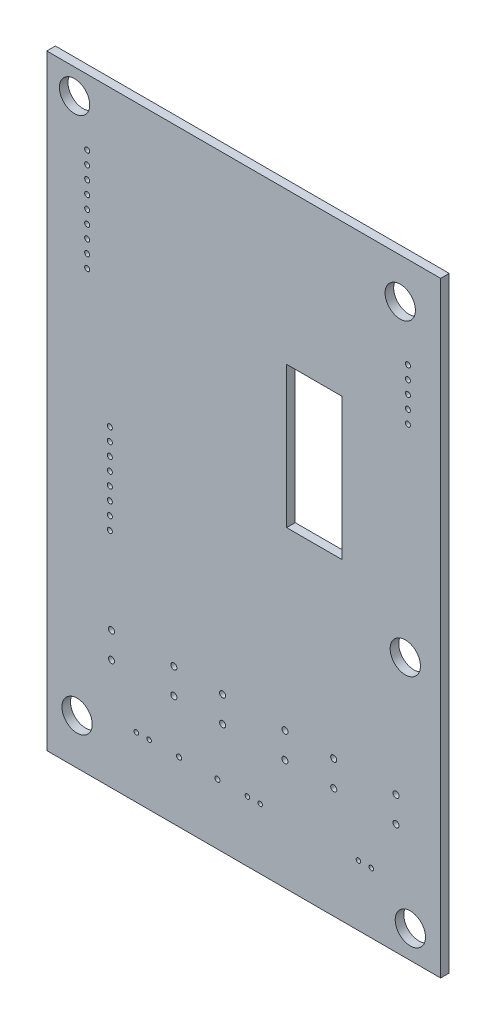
ISO-10303-21;
HEADER;
FILE_DESCRIPTION(('STEP AP214'),'2;1');
FILE_NAME('part.step','',(''),(''),'','','');
FILE_SCHEMA(('AUTOMOTIVE_DESIGN { 1 0 10303 214 1 1 1 1 }'));
ENDSEC;
DATA;
#1=APPLICATION_CONTEXT('core data for automotive mechanical design processes');
#2=APPLICATION_PROTOCOL_DEFINITION('international standard','automotive_design',2000,#1);
#3=PRODUCT_CONTEXT('',#1,'mechanical');
#4=PRODUCT('Part','Part','',(#3));
#5=PRODUCT_RELATED_PRODUCT_CATEGORY('part','',(#4));
#6=PRODUCT_DEFINITION_FORMATION('','',#4);
#7=PRODUCT_DEFINITION_CONTEXT('part definition',#1,'design');
#8=PRODUCT_DEFINITION('design','',#6,#7);
#9=PRODUCT_DEFINITION_SHAPE('','',#8);
#10=(LENGTH_UNIT() NAMED_UNIT(*) SI_UNIT(.MILLI.,.METRE.));
#11=(NAMED_UNIT(*) PLANE_ANGLE_UNIT() SI_UNIT($,.RADIAN.));
#12=(NAMED_UNIT(*) SI_UNIT($,.STERADIAN.) SOLID_ANGLE_UNIT());
#13=UNCERTAINTY_MEASURE_WITH_UNIT(LENGTH_MEASURE(1.E-05),#10,'distance_accuracy_value','');
#14=(GEOMETRIC_REPRESENTATION_CONTEXT(3) GLOBAL_UNCERTAINTY_ASSIGNED_CONTEXT((#13)) GLOBAL_UNIT_ASSIGNED_CONTEXT((#10,
#11,#12)) REPRESENTATION_CONTEXT('',''));
#15=CARTESIAN_POINT('',(0.,0.,0.));
#16=DIRECTION('',(0.,0.,1.));
#17=DIRECTION('',(1.,0.,0.));
#18=AXIS2_PLACEMENT_3D('',#15,#16,#17);
#19=CARTESIAN_POINT('',(0.,0.,1.7));
#20=DIRECTION('',(0.,0.,-1.));
#21=DIRECTION('',(-1.,0.,0.));
#22=AXIS2_PLACEMENT_3D('',#19,#20,#21);
#23=PLANE('',#22);
#24=CARTESIAN_POINT('',(33.,-134.,1.7));
#25=DIRECTION('',(0.,0.,1.));
#26=DIRECTION('',(1.,0.,0.));
#27=AXIS2_PLACEMENT_3D('',#24,#25,#26);
#28=CIRCLE('',#27,3.);
#29=CARTESIAN_POINT('',(36.,-134.,1.7));
#30=VERTEX_POINT('',#29);
#31=EDGE_CURVE('E142',#30,#30,#28,.T.);
#32=ORIENTED_EDGE('',*,*,#31,.F.);
#33=EDGE_LOOP('',(#32));
#34=FACE_BOUND('',#33,.T.);
#35=CARTESIAN_POINT('',(44.725,-131.,1.7));
#36=DIRECTION('',(0.,0.,1.));
#37=DIRECTION('',(1.,0.,0.));
#38=AXIS2_PLACEMENT_3D('',#35,#36,#37);
#39=CIRCLE('',#38,0.45000000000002);
#40=CARTESIAN_POINT('',(45.175,-131.,1.7));
#41=VERTEX_POINT('',#40);
#42=EDGE_CURVE('E148',#41,#41,#39,.T.);
#43=ORIENTED_EDGE('',*,*,#42,.F.);
#44=EDGE_LOOP('',(#43));
#45=FACE_BOUND('',#44,.T.);
#46=CARTESIAN_POINT('',(47.265,-131.,1.7));
#47=DIRECTION('',(0.,0.,1.));
#48=DIRECTION('',(1.,0.,0.));
#49=AXIS2_PLACEMENT_3D('',#46,#47,#48);
#50=CIRCLE('',#49,0.45000000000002);
#51=CARTESIAN_POINT('',(47.715,-131.,1.7));
#52=VERTEX_POINT('',#51);
#53=EDGE_CURVE('E154',#52,#52,#50,.T.);
#54=ORIENTED_EDGE('',*,*,#53,.F.);
#55=EDGE_LOOP('',(#54));
#56=FACE_BOUND('',#55,.T.);
#57=CARTESIAN_POINT('',(39.83,-121.04,1.7));
#58=DIRECTION('',(0.,0.,1.));
#59=DIRECTION('',(1.,0.,0.));
#60=AXIS2_PLACEMENT_3D('',#57,#58,#59);
#61=CIRCLE('',#60,0.60000000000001);
#62=CARTESIAN_POINT('',(40.43,-121.04,1.7));
#63=VERTEX_POINT('',#62);
#64=EDGE_CURVE('E160',#63,#63,#61,.T.);
#65=ORIENTED_EDGE('',*,*,#64,.F.);
#66=EDGE_LOOP('',(#65));
#67=FACE_BOUND('',#66,.T.);
#68=CARTESIAN_POINT('',(39.82,-115.95,1.7));
#69=DIRECTION('',(0.,0.,1.));
#70=DIRECTION('',(1.,0.,0.));
#71=AXIS2_PLACEMENT_3D('',#68,#69,#70);
#72=CIRCLE('',#71,0.599999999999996);
#73=CARTESIAN_POINT('',(40.42,-115.95,1.7));
#74=VERTEX_POINT('',#73);
#75=EDGE_CURVE('E166',#74,#74,#72,.T.);
#76=ORIENTED_EDGE('',*,*,#75,.F.);
#77=EDGE_LOOP('',(#76));
#78=FACE_BOUND('',#77,.T.);
#79=CARTESIAN_POINT('',(53.2,-131.,1.7));
#80=DIRECTION('',(0.,0.,1.));
#81=DIRECTION('',(1.,0.,0.));
#82=AXIS2_PLACEMENT_3D('',#79,#80,#81);
#83=CIRCLE('',#82,0.5);
#84=CARTESIAN_POINT('',(53.7,-131.,1.7));
#85=VERTEX_POINT('',#84);
#86=EDGE_CURVE('E172',#85,#85,#83,.T.);
#87=ORIENTED_EDGE('',*,*,#86,.F.);
#88=EDGE_LOOP('',(#87));
#89=FACE_BOUND('',#88,.T.);
#90=CARTESIAN_POINT('',(60.8,-131.,1.7));
#91=DIRECTION('',(0.,0.,1.));
#92=DIRECTION('',(1.,0.,0.));
#93=AXIS2_PLACEMENT_3D('',#90,#91,#92);
#94=CIRCLE('',#93,0.5);
#95=CARTESIAN_POINT('',(61.3,-131.,1.7));
#96=VERTEX_POINT('',#95);
#97=EDGE_CURVE('E178',#96,#96,#94,.T.);
#98=ORIENTED_EDGE('',*,*,#97,.F.);
#99=EDGE_LOOP('',(#98));
#100=FACE_BOUND('',#99,.T.);
#101=CARTESIAN_POINT('',(52.16,-121.04,1.7));
#102=DIRECTION('',(0.,0.,1.));
#103=DIRECTION('',(1.,0.,0.));
#104=AXIS2_PLACEMENT_3D('',#101,#102,#103);
#105=CIRCLE('',#104,0.60000000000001);
#106=CARTESIAN_POINT('',(52.76,-121.04,1.7));
#107=VERTEX_POINT('',#106);
#108=EDGE_CURVE('E184',#107,#107,#105,.T.);
#109=ORIENTED_EDGE('',*,*,#108,.F.);
#110=EDGE_LOOP('',(#109));
#111=FACE_BOUND('',#110,.T.);
#112=CARTESIAN_POINT('',(52.17,-115.96,1.7));
#113=DIRECTION('',(0.,0.,1.));
#114=DIRECTION('',(1.,0.,0.));
#115=AXIS2_PLACEMENT_3D('',#112,#113,#114);
#116=CIRCLE('',#115,0.60000000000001);
#117=CARTESIAN_POINT('',(52.77,-115.96,1.7));
#118=VERTEX_POINT('',#117);
#119=EDGE_CURVE('E190',#118,#118,#116,.T.);
#120=ORIENTED_EDGE('',*,*,#119,.F.);
#121=EDGE_LOOP('',(#120));
#122=FACE_BOUND('',#121,.T.);
#123=CARTESIAN_POINT('',(61.83,-121.04,1.7));
#124=DIRECTION('',(0.,0.,1.));
#125=DIRECTION('',(1.,0.,0.));
#126=AXIS2_PLACEMENT_3D('',#123,#124,#125);
#127=CIRCLE('',#126,0.60000000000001);
#128=CARTESIAN_POINT('',(62.43,-121.04,1.7));
#129=VERTEX_POINT('',#128);
#130=EDGE_CURVE('E196',#129,#129,#127,.T.);
#131=ORIENTED_EDGE('',*,*,#130,.F.);
#132=EDGE_LOOP('',(#131));
#133=FACE_BOUND('',#132,.T.);
#134=CARTESIAN_POINT('',(61.82,-115.95,1.7));
#135=DIRECTION('',(0.,0.,1.));
#136=DIRECTION('',(1.,0.,0.));
#137=AXIS2_PLACEMENT_3D('',#134,#135,#136);
#138=CIRCLE('',#137,0.599999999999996);
#139=CARTESIAN_POINT('',(62.42,-115.95,1.7));
#140=VERTEX_POINT('',#139);
#141=EDGE_CURVE('E202',#140,#140,#138,.T.);
#142=ORIENTED_EDGE('',*,*,#141,.F.);
#143=EDGE_LOOP('',(#142));
#144=FACE_BOUND('',#143,.T.);
#145=CARTESIAN_POINT('',(39.49,-98.99,1.7));
#146=DIRECTION('',(0.,0.,1.));
#147=DIRECTION('',(1.,0.,0.));
#148=AXIS2_PLACEMENT_3D('',#145,#146,#147);
#149=CIRCLE('',#148,0.5);
#150=CARTESIAN_POINT('',(39.99,-98.99,1.7));
#151=VERTEX_POINT('',#150);
#152=EDGE_CURVE('E208',#151,#151,#149,.T.);
#153=ORIENTED_EDGE('',*,*,#152,.F.);
#154=EDGE_LOOP('',(#153));
#155=FACE_BOUND('',#154,.T.);
#156=CARTESIAN_POINT('',(39.49,-96.45,1.7));
#157=DIRECTION('',(0.,0.,1.));
#158=DIRECTION('',(1.,0.,0.));
#159=AXIS2_PLACEMENT_3D('',#156,#157,#158);
#160=CIRCLE('',#159,0.5);
#161=CARTESIAN_POINT('',(39.99,-96.45,1.7));
#162=VERTEX_POINT('',#161);
#163=EDGE_CURVE('E214',#162,#162,#160,.T.);
#164=ORIENTED_EDGE('',*,*,#163,.F.);
#165=EDGE_LOOP('',(#164));
#166=FACE_BOUND('',#165,.T.);
#167=CARTESIAN_POINT('',(39.49,-93.91,1.7));
#168=DIRECTION('',(0.,0.,1.));
#169=DIRECTION('',(1.,0.,0.));
#170=AXIS2_PLACEMENT_3D('',#167,#168,#169);
#171=CIRCLE('',#170,0.5);
#172=CARTESIAN_POINT('',(39.99,-93.91,1.7));
#173=VERTEX_POINT('',#172);
#174=EDGE_CURVE('E220',#173,#173,#171,.T.);
#175=ORIENTED_EDGE('',*,*,#174,.F.);
#176=EDGE_LOOP('',(#175));
#177=FACE_BOUND('',#176,.T.);
#178=CARTESIAN_POINT('',(39.49,-91.37,1.7));
#179=DIRECTION('',(0.,0.,1.));
#180=DIRECTION('',(1.,0.,0.));
#181=AXIS2_PLACEMENT_3D('',#178,#179,#180);
#182=CIRCLE('',#181,0.499999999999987);
#183=CARTESIAN_POINT('',(39.99,-91.37,1.7));
#184=VERTEX_POINT('',#183);
#185=EDGE_CURVE('E226',#184,#184,#182,.T.);
#186=ORIENTED_EDGE('',*,*,#185,.F.);
#187=EDGE_LOOP('',(#186));
#188=FACE_BOUND('',#187,.T.);
#189=CARTESIAN_POINT('',(39.49,-88.83,1.7));
#190=DIRECTION('',(0.,0.,1.));
#191=DIRECTION('',(1.,0.,0.));
#192=AXIS2_PLACEMENT_3D('',#189,#190,#191);
#193=CIRCLE('',#192,0.5);
#194=CARTESIAN_POINT('',(39.99,-88.83,1.7));
#195=VERTEX_POINT('',#194);
#196=EDGE_CURVE('E232',#195,#195,#193,.T.);
#197=ORIENTED_EDGE('',*,*,#196,.F.);
#198=EDGE_LOOP('',(#197));
#199=FACE_BOUND('',#198,.T.);
#200=CARTESIAN_POINT('',(39.49,-86.29,1.7));
#201=DIRECTION('',(0.,0.,1.));
#202=DIRECTION('',(1.,0.,0.));
#203=AXIS2_PLACEMENT_3D('',#200,#201,#202);
#204=CIRCLE('',#203,0.5);
#205=CARTESIAN_POINT('',(39.99,-86.29,1.7));
#206=VERTEX_POINT('',#205);
#207=EDGE_CURVE('E238',#206,#206,#204,.T.);
#208=ORIENTED_EDGE('',*,*,#207,.F.);
#209=EDGE_LOOP('',(#208));
#210=FACE_BOUND('',#209,.T.);
#211=CARTESIAN_POINT('',(39.49,-83.75,1.7));
#212=DIRECTION('',(0.,0.,1.));
#213=DIRECTION('',(1.,0.,0.));
#214=AXIS2_PLACEMENT_3D('',#211,#212,#213);
#215=CIRCLE('',#214,0.5);
#216=CARTESIAN_POINT('',(39.99,-83.75,1.7));
#217=VERTEX_POINT('',#216);
#218=EDGE_CURVE('E244',#217,#217,#215,.T.);
#219=ORIENTED_EDGE('',*,*,#218,.F.);
#220=EDGE_LOOP('',(#219));
#221=FACE_BOUND('',#220,.T.);
#222=CARTESIAN_POINT('',(66.725,-131.,1.7));
#223=DIRECTION('',(0.,0.,1.));
#224=DIRECTION('',(1.,0.,0.));
#225=AXIS2_PLACEMENT_3D('',#222,#223,#224);
#226=CIRCLE('',#225,0.45000000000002);
#227=CARTESIAN_POINT('',(67.175,-131.,1.7));
#228=VERTEX_POINT('',#227);
#229=EDGE_CURVE('E250',#228,#228,#226,.T.);
#230=ORIENTED_EDGE('',*,*,#229,.F.);
#231=EDGE_LOOP('',(#230));
#232=FACE_BOUND('',#231,.T.);
#233=CARTESIAN_POINT('',(69.265,-131.,1.7));
#234=DIRECTION('',(0.,0.,1.));
#235=DIRECTION('',(1.,0.,0.));
#236=AXIS2_PLACEMENT_3D('',#233,#234,#235);
#237=CIRCLE('',#236,0.45000000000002);
#238=CARTESIAN_POINT('',(69.715,-131.,1.7));
#239=VERTEX_POINT('',#238);
#240=EDGE_CURVE('E256',#239,#239,#237,.T.);
#241=ORIENTED_EDGE('',*,*,#240,.F.);
#242=EDGE_LOOP('',(#241));
#243=FACE_BOUND('',#242,.T.);
#244=CARTESIAN_POINT('',(74.16,-121.04,1.7));
#245=DIRECTION('',(0.,0.,1.));
#246=DIRECTION('',(1.,0.,0.));
#247=AXIS2_PLACEMENT_3D('',#244,#245,#246);
#248=CIRCLE('',#247,0.600000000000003);
#249=CARTESIAN_POINT('',(74.76,-121.04,1.7));
#250=VERTEX_POINT('',#249);
#251=EDGE_CURVE('E262',#250,#250,#248,.T.);
#252=ORIENTED_EDGE('',*,*,#251,.F.);
#253=EDGE_LOOP('',(#252));
#254=FACE_BOUND('',#253,.T.);
#255=CARTESIAN_POINT('',(74.17,-115.96,1.7));
#256=DIRECTION('',(0.,0.,1.));
#257=DIRECTION('',(1.,0.,0.));
#258=AXIS2_PLACEMENT_3D('',#255,#256,#257);
#259=CIRCLE('',#258,0.600000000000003);
#260=CARTESIAN_POINT('',(74.77,-115.96,1.7));
#261=VERTEX_POINT('',#260);
#262=EDGE_CURVE('E268',#261,#261,#259,.T.);
#263=ORIENTED_EDGE('',*,*,#262,.F.);
#264=EDGE_LOOP('',(#263));
#265=FACE_BOUND('',#264,.T.);
#266=CARTESIAN_POINT('',(83.83,-121.04,1.7));
#267=DIRECTION('',(0.,0.,1.));
#268=DIRECTION('',(1.,0.,0.));
#269=AXIS2_PLACEMENT_3D('',#266,#267,#268);
#270=CIRCLE('',#269,0.600000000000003);
#271=CARTESIAN_POINT('',(84.43,-121.04,1.7));
#272=VERTEX_POINT('',#271);
#273=EDGE_CURVE('E274',#272,#272,#270,.T.);
#274=ORIENTED_EDGE('',*,*,#273,.F.);
#275=EDGE_LOOP('',(#274));
#276=FACE_BOUND('',#275,.T.);
#277=CARTESIAN_POINT('',(83.82,-115.95,1.7));
#278=DIRECTION('',(0.,0.,1.));
#279=DIRECTION('',(1.,0.,0.));
#280=AXIS2_PLACEMENT_3D('',#277,#278,#279);
#281=CIRCLE('',#280,0.599999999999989);
#282=CARTESIAN_POINT('',(84.42,-115.95,1.7));
#283=VERTEX_POINT('',#282);
#284=EDGE_CURVE('E280',#283,#283,#281,.T.);
#285=ORIENTED_EDGE('',*,*,#284,.F.);
#286=EDGE_LOOP('',(#285));
#287=FACE_BOUND('',#286,.T.);
#288=CARTESIAN_POINT('',(88.725,-131.,1.7));
#289=DIRECTION('',(0.,0.,1.));
#290=DIRECTION('',(1.,0.,0.));
#291=AXIS2_PLACEMENT_3D('',#288,#289,#290);
#292=CIRCLE('',#291,0.45000000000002);
#293=CARTESIAN_POINT('',(89.175,-131.,1.7));
#294=VERTEX_POINT('',#293);
#295=EDGE_CURVE('E286',#294,#294,#292,.T.);
#296=ORIENTED_EDGE('',*,*,#295,.F.);
#297=EDGE_LOOP('',(#296));
#298=FACE_BOUND('',#297,.T.);
#299=CARTESIAN_POINT('',(91.265,-131.,1.7));
#300=DIRECTION('',(0.,0.,1.));
#301=DIRECTION('',(1.,0.,0.));
#302=AXIS2_PLACEMENT_3D('',#299,#300,#301);
#303=CIRCLE('',#302,0.45000000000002);
#304=CARTESIAN_POINT('',(91.715,-131.,1.7));
#305=VERTEX_POINT('',#304);
#306=EDGE_CURVE('E292',#305,#305,#303,.T.);
#307=ORIENTED_EDGE('',*,*,#306,.F.);
#308=EDGE_LOOP('',(#307));
#309=FACE_BOUND('',#308,.T.);
#310=CARTESIAN_POINT('',(99.,-137.5,1.7));
#311=DIRECTION('',(0.,0.,1.));
#312=DIRECTION('',(1.,0.,0.));
#313=AXIS2_PLACEMENT_3D('',#310,#311,#312);
#314=CIRCLE('',#313,3.);
#315=CARTESIAN_POINT('',(102.,-137.5,1.7));
#316=VERTEX_POINT('',#315);
#317=EDGE_CURVE('E298',#316,#316,#314,.T.);
#318=ORIENTED_EDGE('',*,*,#317,.F.);
#319=EDGE_LOOP('',(#318));
#320=FACE_BOUND('',#319,.T.);
#321=CARTESIAN_POINT('',(96.16,-121.04,1.7));
#322=DIRECTION('',(0.,0.,1.));
#323=DIRECTION('',(1.,0.,0.));
#324=AXIS2_PLACEMENT_3D('',#321,#322,#323);
#325=CIRCLE('',#324,0.600000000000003);
#326=CARTESIAN_POINT('',(96.76,-121.04,1.7));
#327=VERTEX_POINT('',#326);
#328=EDGE_CURVE('E304',#327,#327,#325,.T.);
#329=ORIENTED_EDGE('',*,*,#328,.F.);
#330=EDGE_LOOP('',(#329));
#331=FACE_BOUND('',#330,.T.);
#332=CARTESIAN_POINT('',(96.17,-115.96,1.7));
#333=DIRECTION('',(0.,0.,1.));
#334=DIRECTION('',(1.,0.,0.));
#335=AXIS2_PLACEMENT_3D('',#332,#333,#334);
#336=CIRCLE('',#335,0.600000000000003);
#337=CARTESIAN_POINT('',(96.77,-115.96,1.7));
#338=VERTEX_POINT('',#337);
#339=EDGE_CURVE('E310',#338,#338,#336,.T.);
#340=ORIENTED_EDGE('',*,*,#339,.F.);
#341=EDGE_LOOP('',(#340));
#342=FACE_BOUND('',#341,.T.);
#343=CARTESIAN_POINT('',(98.,-91.5,1.7));
#344=DIRECTION('',(0.,0.,1.));
#345=DIRECTION('',(1.,0.,0.));
#346=AXIS2_PLACEMENT_3D('',#343,#344,#345);
#347=CIRCLE('',#346,3.);
#348=CARTESIAN_POINT('',(101.,-91.5,1.7));
#349=VERTEX_POINT('',#348);
#350=EDGE_CURVE('E316',#349,#349,#347,.T.);
#351=ORIENTED_EDGE('',*,*,#350,.F.);
#352=EDGE_LOOP('',(#351));
#353=FACE_BOUND('',#352,.T.);
#354=CARTESIAN_POINT('',(39.49,-81.21,1.7));
#355=DIRECTION('',(0.,0.,1.));
#356=DIRECTION('',(1.,0.,0.));
#357=AXIS2_PLACEMENT_3D('',#354,#355,#356);
#358=CIRCLE('',#357,0.5);
#359=CARTESIAN_POINT('',(39.99,-81.21,1.7));
#360=VERTEX_POINT('',#359);
#361=EDGE_CURVE('E322',#360,#360,#358,.T.);
#362=ORIENTED_EDGE('',*,*,#361,.F.);
#363=EDGE_LOOP('',(#362));
#364=FACE_BOUND('',#363,.T.);
#365=CARTESIAN_POINT('',(35.,-56.32,1.7));
#366=DIRECTION('',(0.,0.,1.));
#367=DIRECTION('',(1.,0.,0.));
#368=AXIS2_PLACEMENT_3D('',#365,#366,#367);
#369=CIRCLE('',#368,0.5);
#370=CARTESIAN_POINT('',(35.5,-56.32,1.7));
#371=VERTEX_POINT('',#370);
#372=EDGE_CURVE('E328',#371,#371,#369,.T.);
#373=ORIENTED_EDGE('',*,*,#372,.F.);
#374=EDGE_LOOP('',(#373));
#375=FACE_BOUND('',#374,.T.);
#376=CARTESIAN_POINT('',(35.,-53.78,1.7));
#377=DIRECTION('',(0.,0.,1.));
#378=DIRECTION('',(1.,0.,0.));
#379=AXIS2_PLACEMENT_3D('',#376,#377,#378);
#380=CIRCLE('',#379,0.5);
#381=CARTESIAN_POINT('',(35.5,-53.78,1.7));
#382=VERTEX_POINT('',#381);
#383=EDGE_CURVE('E334',#382,#382,#380,.T.);
#384=ORIENTED_EDGE('',*,*,#383,.F.);
#385=EDGE_LOOP('',(#384));
#386=FACE_BOUND('',#385,.T.);
#387=CARTESIAN_POINT('',(35.,-51.24,1.7));
#388=DIRECTION('',(0.,0.,1.));
#389=DIRECTION('',(1.,0.,0.));
#390=AXIS2_PLACEMENT_3D('',#387,#388,#389);
#391=CIRCLE('',#390,0.5);
#392=CARTESIAN_POINT('',(35.5,-51.24,1.7));
#393=VERTEX_POINT('',#392);
#394=EDGE_CURVE('E340',#393,#393,#391,.T.);
#395=ORIENTED_EDGE('',*,*,#394,.F.);
#396=EDGE_LOOP('',(#395));
#397=FACE_BOUND('',#396,.T.);
#398=CARTESIAN_POINT('',(35.,-48.7,1.7));
#399=DIRECTION('',(0.,0.,1.));
#400=DIRECTION('',(1.,0.,0.));
#401=AXIS2_PLACEMENT_3D('',#398,#399,#400);
#402=CIRCLE('',#401,0.5);
#403=CARTESIAN_POINT('',(35.5,-48.7,1.7));
#404=VERTEX_POINT('',#403);
#405=EDGE_CURVE('E346',#404,#404,#402,.T.);
#406=ORIENTED_EDGE('',*,*,#405,.F.);
#407=EDGE_LOOP('',(#406));
#408=FACE_BOUND('',#407,.T.);
#409=CARTESIAN_POINT('',(35.,-46.16,1.7));
#410=DIRECTION('',(0.,0.,1.));
#411=DIRECTION('',(1.,0.,0.));
#412=AXIS2_PLACEMENT_3D('',#409,#410,#411);
#413=CIRCLE('',#412,0.5);
#414=CARTESIAN_POINT('',(35.5,-46.16,1.7));
#415=VERTEX_POINT('',#414);
#416=EDGE_CURVE('E352',#415,#415,#413,.T.);
#417=ORIENTED_EDGE('',*,*,#416,.F.);
#418=EDGE_LOOP('',(#417));
#419=FACE_BOUND('',#418,.T.);
#420=CARTESIAN_POINT('',(35.,-43.62,1.7));
#421=DIRECTION('',(0.,0.,1.));
#422=DIRECTION('',(1.,0.,0.));
#423=AXIS2_PLACEMENT_3D('',#420,#421,#422);
#424=CIRCLE('',#423,0.5);
#425=CARTESIAN_POINT('',(35.5,-43.62,1.7));
#426=VERTEX_POINT('',#425);
#427=EDGE_CURVE('E358',#426,#426,#424,.T.);
#428=ORIENTED_EDGE('',*,*,#427,.F.);
#429=EDGE_LOOP('',(#428));
#430=FACE_BOUND('',#429,.T.);
#431=CARTESIAN_POINT('',(35.,-41.08,1.7));
#432=DIRECTION('',(0.,0.,1.));
#433=DIRECTION('',(1.,0.,0.));
#434=AXIS2_PLACEMENT_3D('',#431,#432,#433);
#435=CIRCLE('',#434,0.5);
#436=CARTESIAN_POINT('',(35.5,-41.08,1.7));
#437=VERTEX_POINT('',#436);
#438=EDGE_CURVE('E364',#437,#437,#435,.T.);
#439=ORIENTED_EDGE('',*,*,#438,.F.);
#440=EDGE_LOOP('',(#439));
#441=FACE_BOUND('',#440,.T.);
#442=CARTESIAN_POINT('',(35.,-38.54,1.7));
#443=DIRECTION('',(0.,0.,1.));
#444=DIRECTION('',(1.,0.,0.));
#445=AXIS2_PLACEMENT_3D('',#442,#443,#444);
#446=CIRCLE('',#445,0.5);
#447=CARTESIAN_POINT('',(35.5,-38.54,1.7));
#448=VERTEX_POINT('',#447);
#449=EDGE_CURVE('E370',#448,#448,#446,.T.);
#450=ORIENTED_EDGE('',*,*,#449,.F.);
#451=EDGE_LOOP('',(#450));
#452=FACE_BOUND('',#451,.T.);
#453=CARTESIAN_POINT('',(35.,-36.,1.7));
#454=DIRECTION('',(0.,0.,1.));
#455=DIRECTION('',(1.,0.,0.));
#456=AXIS2_PLACEMENT_3D('',#453,#454,#455);
#457=CIRCLE('',#456,0.5);
#458=CARTESIAN_POINT('',(35.5,-36.,1.7));
#459=VERTEX_POINT('',#458);
#460=EDGE_CURVE('E376',#459,#459,#457,.T.);
#461=ORIENTED_EDGE('',*,*,#460,.F.);
#462=EDGE_LOOP('',(#461));
#463=FACE_BOUND('',#462,.T.);
#464=CARTESIAN_POINT('',(32.5,-28.,1.7));
#465=DIRECTION('',(0.,0.,1.));
#466=DIRECTION('',(1.,0.,0.));
#467=AXIS2_PLACEMENT_3D('',#464,#465,#466);
#468=CIRCLE('',#467,3.);
#469=CARTESIAN_POINT('',(35.5,-28.,1.7));
#470=VERTEX_POINT('',#469);
#471=EDGE_CURVE('E382',#470,#470,#468,.T.);
#472=ORIENTED_EDGE('',*,*,#471,.F.);
#473=EDGE_LOOP('',(#472));
#474=FACE_BOUND('',#473,.T.);
#475=CARTESIAN_POINT('',(98.52,-51.24,1.7));
#476=DIRECTION('',(0.,0.,1.));
#477=DIRECTION('',(1.,0.,0.));
#478=AXIS2_PLACEMENT_3D('',#475,#476,#477);
#479=CIRCLE('',#478,0.5);
#480=CARTESIAN_POINT('',(99.02,-51.24,1.7));
#481=VERTEX_POINT('',#480);
#482=EDGE_CURVE('E388',#481,#481,#479,.T.);
#483=ORIENTED_EDGE('',*,*,#482,.F.);
#484=EDGE_LOOP('',(#483));
#485=FACE_BOUND('',#484,.T.);
#486=CARTESIAN_POINT('',(98.52,-48.7,1.7));
#487=DIRECTION('',(0.,0.,1.));
#488=DIRECTION('',(1.,0.,0.));
#489=AXIS2_PLACEMENT_3D('',#486,#487,#488);
#490=CIRCLE('',#489,0.5);
#491=CARTESIAN_POINT('',(99.02,-48.7,1.7));
#492=VERTEX_POINT('',#491);
#493=EDGE_CURVE('E394',#492,#492,#490,.T.);
#494=ORIENTED_EDGE('',*,*,#493,.F.);
#495=EDGE_LOOP('',(#494));
#496=FACE_BOUND('',#495,.T.);
#497=CARTESIAN_POINT('',(98.52,-46.16,1.7));
#498=DIRECTION('',(0.,0.,1.));
#499=DIRECTION('',(1.,0.,0.));
#500=AXIS2_PLACEMENT_3D('',#497,#498,#499);
#501=CIRCLE('',#500,0.5);
#502=CARTESIAN_POINT('',(99.02,-46.16,1.7));
#503=VERTEX_POINT('',#502);
#504=EDGE_CURVE('E400',#503,#503,#501,.T.);
#505=ORIENTED_EDGE('',*,*,#504,.F.);
#506=EDGE_LOOP('',(#505));
#507=FACE_BOUND('',#506,.T.);
#508=CARTESIAN_POINT('',(98.52,-43.62,1.7));
#509=DIRECTION('',(0.,0.,1.));
#510=DIRECTION('',(1.,0.,0.));
#511=AXIS2_PLACEMENT_3D('',#508,#509,#510);
#512=CIRCLE('',#511,0.5);
#513=CARTESIAN_POINT('',(99.02,-43.62,1.7));
#514=VERTEX_POINT('',#513);
#515=EDGE_CURVE('E406',#514,#514,#512,.T.);
#516=ORIENTED_EDGE('',*,*,#515,.F.);
#517=EDGE_LOOP('',(#516));
#518=FACE_BOUND('',#517,.T.);
#519=CARTESIAN_POINT('',(98.52,-41.08,1.7));
#520=DIRECTION('',(0.,0.,1.));
#521=DIRECTION('',(1.,0.,0.));
#522=AXIS2_PLACEMENT_3D('',#519,#520,#521);
#523=CIRCLE('',#522,0.5);
#524=CARTESIAN_POINT('',(99.02,-41.08,1.7));
#525=VERTEX_POINT('',#524);
#526=EDGE_CURVE('E412',#525,#525,#523,.T.);
#527=ORIENTED_EDGE('',*,*,#526,.F.);
#528=EDGE_LOOP('',(#527));
#529=FACE_BOUND('',#528,.T.);
#530=CARTESIAN_POINT('',(97.,-31.,1.7));
#531=DIRECTION('',(0.,0.,1.));
#532=DIRECTION('',(1.,0.,0.));
#533=AXIS2_PLACEMENT_3D('',#530,#531,#532);
#534=CIRCLE('',#533,3.);
#535=CARTESIAN_POINT('',(100.,-31.,1.7));
#536=VERTEX_POINT('',#535);
#537=EDGE_CURVE('E418',#536,#536,#534,.T.);
#538=ORIENTED_EDGE('',*,*,#537,.F.);
#539=EDGE_LOOP('',(#538));
#540=FACE_BOUND('',#539,.T.);
#541=DIRECTION('',(1.,0.,0.));
#542=VECTOR('',#541,1.);
#543=CARTESIAN_POINT('',(105.,-143.,1.7));
#544=LINE('',#543,#542);
#545=CARTESIAN_POINT('',(27.,-143.,1.7));
#546=VERTEX_POINT('',#545);
#547=CARTESIAN_POINT('',(105.,-143.,1.7));
#548=VERTEX_POINT('',#547);
#549=EDGE_CURVE('E424',#546,#548,#544,.T.);
#550=ORIENTED_EDGE('',*,*,#549,.T.);
#551=DIRECTION('',(0.,1.,0.));
#552=VECTOR('',#551,1.);
#553=CARTESIAN_POINT('',(105.,-23.,1.7));
#554=LINE('',#553,#552);
#555=CARTESIAN_POINT('',(105.,-23.,1.7));
#556=VERTEX_POINT('',#555);
#557=EDGE_CURVE('E427',#548,#556,#554,.T.);
#558=ORIENTED_EDGE('',*,*,#557,.T.);
#559=DIRECTION('',(-1.,0.,0.));
#560=VECTOR('',#559,1.);
#561=CARTESIAN_POINT('',(27.,-23.,1.7));
#562=LINE('',#561,#560);
#563=CARTESIAN_POINT('',(27.,-23.,1.7));
#564=VERTEX_POINT('',#563);
#565=EDGE_CURVE('E430',#556,#564,#562,.T.);
#566=ORIENTED_EDGE('',*,*,#565,.T.);
#567=DIRECTION('',(0.,-1.,0.));
#568=VECTOR('',#567,1.);
#569=CARTESIAN_POINT('',(27.,-143.,1.7));
#570=LINE('',#569,#568);
#571=EDGE_CURVE('E432',#564,#546,#570,.T.);
#572=ORIENTED_EDGE('',*,*,#571,.T.);
#573=EDGE_LOOP('',(#550,#558,#566,#572));
#574=FACE_BOUND('',#573,.T.);
#575=DIRECTION('',(1.,0.,0.));
#576=VECTOR('',#575,1.);
#577=CARTESIAN_POINT('',(74.5,-81.,1.7));
#578=LINE('',#577,#576);
#579=CARTESIAN_POINT('',(74.5,-81.,1.7));
#580=VERTEX_POINT('',#579);
#581=CARTESIAN_POINT('',(85.5,-81.,1.7));
#582=VERTEX_POINT('',#581);
#583=EDGE_CURVE('E106',#580,#582,#578,.T.);
#584=ORIENTED_EDGE('',*,*,#583,.F.);
#585=DIRECTION('',(0.,-1.,0.));
#586=VECTOR('',#585,1.);
#587=CARTESIAN_POINT('',(74.5,-53.,1.7));
#588=LINE('',#587,#586);
#589=CARTESIAN_POINT('',(74.5,-53.,1.7));
#590=VERTEX_POINT('',#589);
#591=EDGE_CURVE('E128',#590,#580,#588,.T.);
#592=ORIENTED_EDGE('',*,*,#591,.F.);
#593=DIRECTION('',(-1.,0.,0.));
#594=VECTOR('',#593,1.);
#595=CARTESIAN_POINT('',(85.5,-53.,1.7));
#596=LINE('',#595,#594);
#597=CARTESIAN_POINT('',(85.5,-53.,1.7));
#598=VERTEX_POINT('',#597);
#599=EDGE_CURVE('E126',#598,#590,#596,.T.);
#600=ORIENTED_EDGE('',*,*,#599,.F.);
#601=DIRECTION('',(0.,1.,0.));
#602=VECTOR('',#601,1.);
#603=CARTESIAN_POINT('',(85.5,-81.,1.7));
#604=LINE('',#603,#602);
#605=EDGE_CURVE('E114',#582,#598,#604,.T.);
#606=ORIENTED_EDGE('',*,*,#605,.F.);
#607=EDGE_LOOP('',(#584,#592,#600,#606));
#608=FACE_BOUND('',#607,.T.);
#609=ADVANCED_FACE('F41',(#34,#45,#56,#67,#78,#89,#100,#111,#122,#133,#144,#155,#166,#177,#188,
#199,#210,#221,#232,#243,#254,#265,#276,#287,#298,#309,#320,#331,#342,#353,#364,#375,#386,#397,
#408,#419,#430,#441,#452,#463,#474,#485,#496,#507,#518,#529,#540,#574,#608),#23,.F.);
#610=CARTESIAN_POINT('',(0.,0.,0.));
#611=DIRECTION('',(0.,0.,-1.));
#612=DIRECTION('',(-1.,0.,0.));
#613=AXIS2_PLACEMENT_3D('',#610,#611,#612);
#614=PLANE('',#613);
#615=CARTESIAN_POINT('',(44.725,-131.,0.));
#616=DIRECTION('',(0.,0.,1.));
#617=DIRECTION('',(1.,0.,0.));
#618=AXIS2_PLACEMENT_3D('',#615,#616,#617);
#619=CIRCLE('',#618,0.45000000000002);
#620=CARTESIAN_POINT('',(45.175,-131.,0.));
#621=VERTEX_POINT('',#620);
#622=EDGE_CURVE('E145',#621,#621,#619,.T.);
#623=ORIENTED_EDGE('',*,*,#622,.T.);
#624=EDGE_LOOP('',(#623));
#625=FACE_BOUND('',#624,.T.);
#626=CARTESIAN_POINT('',(39.83,-121.04,0.));
#627=DIRECTION('',(0.,0.,1.));
#628=DIRECTION('',(1.,0.,0.));
#629=AXIS2_PLACEMENT_3D('',#626,#627,#628);
#630=CIRCLE('',#629,0.60000000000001);
#631=CARTESIAN_POINT('',(40.43,-121.04,0.));
#632=VERTEX_POINT('',#631);
#633=EDGE_CURVE('E157',#632,#632,#630,.T.);
#634=ORIENTED_EDGE('',*,*,#633,.T.);
#635=EDGE_LOOP('',(#634));
#636=FACE_BOUND('',#635,.T.);
#637=CARTESIAN_POINT('',(53.2,-131.,0.));
#638=DIRECTION('',(0.,0.,1.));
#639=DIRECTION('',(1.,0.,0.));
#640=AXIS2_PLACEMENT_3D('',#637,#638,#639);
#641=CIRCLE('',#640,0.5);
#642=CARTESIAN_POINT('',(53.7,-131.,0.));
#643=VERTEX_POINT('',#642);
#644=EDGE_CURVE('E169',#643,#643,#641,.T.);
#645=ORIENTED_EDGE('',*,*,#644,.T.);
#646=EDGE_LOOP('',(#645));
#647=FACE_BOUND('',#646,.T.);
#648=CARTESIAN_POINT('',(52.16,-121.04,0.));
#649=DIRECTION('',(0.,0.,1.));
#650=DIRECTION('',(1.,0.,0.));
#651=AXIS2_PLACEMENT_3D('',#648,#649,#650);
#652=CIRCLE('',#651,0.60000000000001);
#653=CARTESIAN_POINT('',(52.76,-121.04,0.));
#654=VERTEX_POINT('',#653);
#655=EDGE_CURVE('E181',#654,#654,#652,.T.);
#656=ORIENTED_EDGE('',*,*,#655,.T.);
#657=EDGE_LOOP('',(#656));
#658=FACE_BOUND('',#657,.T.);
#659=CARTESIAN_POINT('',(61.83,-121.04,0.));
#660=DIRECTION('',(0.,0.,1.));
#661=DIRECTION('',(1.,0.,0.));
#662=AXIS2_PLACEMENT_3D('',#659,#660,#661);
#663=CIRCLE('',#662,0.60000000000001);
#664=CARTESIAN_POINT('',(62.43,-121.04,0.));
#665=VERTEX_POINT('',#664);
#666=EDGE_CURVE('E193',#665,#665,#663,.T.);
#667=ORIENTED_EDGE('',*,*,#666,.T.);
#668=EDGE_LOOP('',(#667));
#669=FACE_BOUND('',#668,.T.);
#670=CARTESIAN_POINT('',(39.49,-98.99,0.));
#671=DIRECTION('',(0.,0.,1.));
#672=DIRECTION('',(1.,0.,0.));
#673=AXIS2_PLACEMENT_3D('',#670,#671,#672);
#674=CIRCLE('',#673,0.5);
#675=CARTESIAN_POINT('',(39.99,-98.99,0.));
#676=VERTEX_POINT('',#675);
#677=EDGE_CURVE('E205',#676,#676,#674,.T.);
#678=ORIENTED_EDGE('',*,*,#677,.T.);
#679=EDGE_LOOP('',(#678));
#680=FACE_BOUND('',#679,.T.);
#681=CARTESIAN_POINT('',(39.49,-93.91,0.));
#682=DIRECTION('',(0.,0.,1.));
#683=DIRECTION('',(1.,0.,0.));
#684=AXIS2_PLACEMENT_3D('',#681,#682,#683);
#685=CIRCLE('',#684,0.5);
#686=CARTESIAN_POINT('',(39.99,-93.91,0.));
#687=VERTEX_POINT('',#686);
#688=EDGE_CURVE('E217',#687,#687,#685,.T.);
#689=ORIENTED_EDGE('',*,*,#688,.T.);
#690=EDGE_LOOP('',(#689));
#691=FACE_BOUND('',#690,.T.);
#692=CARTESIAN_POINT('',(39.49,-88.83,0.));
#693=DIRECTION('',(0.,0.,1.));
#694=DIRECTION('',(1.,0.,0.));
#695=AXIS2_PLACEMENT_3D('',#692,#693,#694);
#696=CIRCLE('',#695,0.5);
#697=CARTESIAN_POINT('',(39.99,-88.83,0.));
#698=VERTEX_POINT('',#697);
#699=EDGE_CURVE('E229',#698,#698,#696,.T.);
#700=ORIENTED_EDGE('',*,*,#699,.T.);
#701=EDGE_LOOP('',(#700));
#702=FACE_BOUND('',#701,.T.);
#703=CARTESIAN_POINT('',(39.49,-83.75,0.));
#704=DIRECTION('',(0.,0.,1.));
#705=DIRECTION('',(1.,0.,0.));
#706=AXIS2_PLACEMENT_3D('',#703,#704,#705);
#707=CIRCLE('',#706,0.5);
#708=CARTESIAN_POINT('',(39.99,-83.75,0.));
#709=VERTEX_POINT('',#708);
#710=EDGE_CURVE('E241',#709,#709,#707,.T.);
#711=ORIENTED_EDGE('',*,*,#710,.T.);
#712=EDGE_LOOP('',(#711));
#713=FACE_BOUND('',#712,.T.);
#714=CARTESIAN_POINT('',(69.265,-131.,0.));
#715=DIRECTION('',(0.,0.,1.));
#716=DIRECTION('',(1.,0.,0.));
#717=AXIS2_PLACEMENT_3D('',#714,#715,#716);
#718=CIRCLE('',#717,0.45000000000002);
#719=CARTESIAN_POINT('',(69.715,-131.,0.));
#720=VERTEX_POINT('',#719);
#721=EDGE_CURVE('E253',#720,#720,#718,.T.);
#722=ORIENTED_EDGE('',*,*,#721,.T.);
#723=EDGE_LOOP('',(#722));
#724=FACE_BOUND('',#723,.T.);
#725=CARTESIAN_POINT('',(74.17,-115.96,0.));
#726=DIRECTION('',(0.,0.,1.));
#727=DIRECTION('',(1.,0.,0.));
#728=AXIS2_PLACEMENT_3D('',#725,#726,#727);
#729=CIRCLE('',#728,0.600000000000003);
#730=CARTESIAN_POINT('',(74.77,-115.96,0.));
#731=VERTEX_POINT('',#730);
#732=EDGE_CURVE('E265',#731,#731,#729,.T.);
#733=ORIENTED_EDGE('',*,*,#732,.T.);
#734=EDGE_LOOP('',(#733));
#735=FACE_BOUND('',#734,.T.);
#736=CARTESIAN_POINT('',(83.82,-115.95,0.));
#737=DIRECTION('',(0.,0.,1.));
#738=DIRECTION('',(1.,0.,0.));
#739=AXIS2_PLACEMENT_3D('',#736,#737,#738);
#740=CIRCLE('',#739,0.599999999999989);
#741=CARTESIAN_POINT('',(84.42,-115.95,0.));
#742=VERTEX_POINT('',#741);
#743=EDGE_CURVE('E277',#742,#742,#740,.T.);
#744=ORIENTED_EDGE('',*,*,#743,.T.);
#745=EDGE_LOOP('',(#744));
#746=FACE_BOUND('',#745,.T.);
#747=CARTESIAN_POINT('',(91.265,-131.,0.));
#748=DIRECTION('',(0.,0.,1.));
#749=DIRECTION('',(1.,0.,0.));
#750=AXIS2_PLACEMENT_3D('',#747,#748,#749);
#751=CIRCLE('',#750,0.45000000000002);
#752=CARTESIAN_POINT('',(91.715,-131.,0.));
#753=VERTEX_POINT('',#752);
#754=EDGE_CURVE('E289',#753,#753,#751,.T.);
#755=ORIENTED_EDGE('',*,*,#754,.T.);
#756=EDGE_LOOP('',(#755));
#757=FACE_BOUND('',#756,.T.);
#758=CARTESIAN_POINT('',(96.16,-121.04,0.));
#759=DIRECTION('',(0.,0.,1.));
#760=DIRECTION('',(1.,0.,0.));
#761=AXIS2_PLACEMENT_3D('',#758,#759,#760);
#762=CIRCLE('',#761,0.600000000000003);
#763=CARTESIAN_POINT('',(96.76,-121.04,0.));
#764=VERTEX_POINT('',#763);
#765=EDGE_CURVE('E301',#764,#764,#762,.T.);
#766=ORIENTED_EDGE('',*,*,#765,.T.);
#767=EDGE_LOOP('',(#766));
#768=FACE_BOUND('',#767,.T.);
#769=CARTESIAN_POINT('',(98.,-91.5,0.));
#770=DIRECTION('',(0.,0.,1.));
#771=DIRECTION('',(1.,0.,0.));
#772=AXIS2_PLACEMENT_3D('',#769,#770,#771);
#773=CIRCLE('',#772,3.);
#774=CARTESIAN_POINT('',(101.,-91.5,0.));
#775=VERTEX_POINT('',#774);
#776=EDGE_CURVE('E313',#775,#775,#773,.T.);
#777=ORIENTED_EDGE('',*,*,#776,.T.);
#778=EDGE_LOOP('',(#777));
#779=FACE_BOUND('',#778,.T.);
#780=CARTESIAN_POINT('',(35.,-56.32,0.));
#781=DIRECTION('',(0.,0.,1.));
#782=DIRECTION('',(1.,0.,0.));
#783=AXIS2_PLACEMENT_3D('',#780,#781,#782);
#784=CIRCLE('',#783,0.5);
#785=CARTESIAN_POINT('',(35.5,-56.32,0.));
#786=VERTEX_POINT('',#785);
#787=EDGE_CURVE('E325',#786,#786,#784,.T.);
#788=ORIENTED_EDGE('',*,*,#787,.T.);
#789=EDGE_LOOP('',(#788));
#790=FACE_BOUND('',#789,.T.);
#791=CARTESIAN_POINT('',(35.,-51.24,0.));
#792=DIRECTION('',(0.,0.,1.));
#793=DIRECTION('',(1.,0.,0.));
#794=AXIS2_PLACEMENT_3D('',#791,#792,#793);
#795=CIRCLE('',#794,0.5);
#796=CARTESIAN_POINT('',(35.5,-51.24,0.));
#797=VERTEX_POINT('',#796);
#798=EDGE_CURVE('E337',#797,#797,#795,.T.);
#799=ORIENTED_EDGE('',*,*,#798,.T.);
#800=EDGE_LOOP('',(#799));
#801=FACE_BOUND('',#800,.T.);
#802=CARTESIAN_POINT('',(35.,-46.16,0.));
#803=DIRECTION('',(0.,0.,1.));
#804=DIRECTION('',(1.,0.,0.));
#805=AXIS2_PLACEMENT_3D('',#802,#803,#804);
#806=CIRCLE('',#805,0.5);
#807=CARTESIAN_POINT('',(35.5,-46.16,0.));
#808=VERTEX_POINT('',#807);
#809=EDGE_CURVE('E349',#808,#808,#806,.T.);
#810=ORIENTED_EDGE('',*,*,#809,.T.);
#811=EDGE_LOOP('',(#810));
#812=FACE_BOUND('',#811,.T.);
#813=CARTESIAN_POINT('',(35.,-41.08,0.));
#814=DIRECTION('',(0.,0.,1.));
#815=DIRECTION('',(1.,0.,0.));
#816=AXIS2_PLACEMENT_3D('',#813,#814,#815);
#817=CIRCLE('',#816,0.5);
#818=CARTESIAN_POINT('',(35.5,-41.08,0.));
#819=VERTEX_POINT('',#818);
#820=EDGE_CURVE('E361',#819,#819,#817,.T.);
#821=ORIENTED_EDGE('',*,*,#820,.T.);
#822=EDGE_LOOP('',(#821));
#823=FACE_BOUND('',#822,.T.);
#824=CARTESIAN_POINT('',(35.,-36.,0.));
#825=DIRECTION('',(0.,0.,1.));
#826=DIRECTION('',(1.,0.,0.));
#827=AXIS2_PLACEMENT_3D('',#824,#825,#826);
#828=CIRCLE('',#827,0.5);
#829=CARTESIAN_POINT('',(35.5,-36.,0.));
#830=VERTEX_POINT('',#829);
#831=EDGE_CURVE('E373',#830,#830,#828,.T.);
#832=ORIENTED_EDGE('',*,*,#831,.T.);
#833=EDGE_LOOP('',(#832));
#834=FACE_BOUND('',#833,.T.);
#835=CARTESIAN_POINT('',(98.52,-51.24,0.));
#836=DIRECTION('',(0.,0.,1.));
#837=DIRECTION('',(1.,0.,0.));
#838=AXIS2_PLACEMENT_3D('',#835,#836,#837);
#839=CIRCLE('',#838,0.5);
#840=CARTESIAN_POINT('',(99.02,-51.24,0.));
#841=VERTEX_POINT('',#840);
#842=EDGE_CURVE('E385',#841,#841,#839,.T.);
#843=ORIENTED_EDGE('',*,*,#842,.T.);
#844=EDGE_LOOP('',(#843));
#845=FACE_BOUND('',#844,.T.);
#846=CARTESIAN_POINT('',(98.52,-46.16,0.));
#847=DIRECTION('',(0.,0.,1.));
#848=DIRECTION('',(1.,0.,0.));
#849=AXIS2_PLACEMENT_3D('',#846,#847,#848);
#850=CIRCLE('',#849,0.5);
#851=CARTESIAN_POINT('',(99.02,-46.16,0.));
#852=VERTEX_POINT('',#851);
#853=EDGE_CURVE('E397',#852,#852,#850,.T.);
#854=ORIENTED_EDGE('',*,*,#853,.T.);
#855=EDGE_LOOP('',(#854));
#856=FACE_BOUND('',#855,.T.);
#857=CARTESIAN_POINT('',(98.52,-41.08,0.));
#858=DIRECTION('',(0.,0.,1.));
#859=DIRECTION('',(1.,0.,0.));
#860=AXIS2_PLACEMENT_3D('',#857,#858,#859);
#861=CIRCLE('',#860,0.5);
#862=CARTESIAN_POINT('',(99.02,-41.08,0.));
#863=VERTEX_POINT('',#862);
#864=EDGE_CURVE('E409',#863,#863,#861,.T.);
#865=ORIENTED_EDGE('',*,*,#864,.T.);
#866=EDGE_LOOP('',(#865));
#867=FACE_BOUND('',#866,.T.);
#868=DIRECTION('',(1.,0.,0.));
#869=VECTOR('',#868,1.);
#870=CARTESIAN_POINT('',(105.,-143.,0.));
#871=LINE('',#870,#869);
#872=CARTESIAN_POINT('',(27.,-143.,0.));
#873=VERTEX_POINT('',#872);
#874=CARTESIAN_POINT('',(105.,-143.,0.));
#875=VERTEX_POINT('',#874);
#876=EDGE_CURVE('E421',#873,#875,#871,.T.);
#877=ORIENTED_EDGE('',*,*,#876,.F.);
#878=DIRECTION('',(0.,-1.,0.));
#879=VECTOR('',#878,1.);
#880=CARTESIAN_POINT('',(27.,-143.,0.));
#881=LINE('',#880,#879);
#882=CARTESIAN_POINT('',(27.,-23.,0.));
#883=VERTEX_POINT('',#882);
#884=EDGE_CURVE('E428',#883,#873,#881,.T.);
#885=ORIENTED_EDGE('',*,*,#884,.F.);
#886=DIRECTION('',(-1.,0.,0.));
#887=VECTOR('',#886,1.);
#888=CARTESIAN_POINT('',(27.,-23.,0.));
#889=LINE('',#888,#887);
#890=CARTESIAN_POINT('',(105.,-23.,0.));
#891=VERTEX_POINT('',#890);
#892=EDGE_CURVE('E439',#891,#883,#889,.T.);
#893=ORIENTED_EDGE('',*,*,#892,.F.);
#894=DIRECTION('',(0.,1.,0.));
#895=VECTOR('',#894,1.);
#896=CARTESIAN_POINT('',(105.,-23.,0.));
#897=LINE('',#896,#895);
#898=EDGE_CURVE('E437',#875,#891,#897,.T.);
#899=ORIENTED_EDGE('',*,*,#898,.F.);
#900=EDGE_LOOP('',(#877,#885,#893,#899));
#901=FACE_BOUND('',#900,.T.);
#902=CARTESIAN_POINT('',(97.,-31.,0.));
#903=DIRECTION('',(0.,0.,1.));
#904=DIRECTION('',(1.,0.,0.));
#905=AXIS2_PLACEMENT_3D('',#902,#903,#904);
#906=CIRCLE('',#905,3.);
#907=CARTESIAN_POINT('',(100.,-31.,0.));
#908=VERTEX_POINT('',#907);
#909=EDGE_CURVE('E415',#908,#908,#906,.T.);
#910=ORIENTED_EDGE('',*,*,#909,.T.);
#911=EDGE_LOOP('',(#910));
#912=FACE_BOUND('',#911,.T.);
#913=CARTESIAN_POINT('',(98.52,-43.62,0.));
#914=DIRECTION('',(0.,0.,1.));
#915=DIRECTION('',(1.,0.,0.));
#916=AXIS2_PLACEMENT_3D('',#913,#914,#915);
#917=CIRCLE('',#916,0.5);
#918=CARTESIAN_POINT('',(99.02,-43.62,0.));
#919=VERTEX_POINT('',#918);
#920=EDGE_CURVE('E403',#919,#919,#917,.T.);
#921=ORIENTED_EDGE('',*,*,#920,.T.);
#922=EDGE_LOOP('',(#921));
#923=FACE_BOUND('',#922,.T.);
#924=CARTESIAN_POINT('',(98.52,-48.7,0.));
#925=DIRECTION('',(0.,0.,1.));
#926=DIRECTION('',(1.,0.,0.));
#927=AXIS2_PLACEMENT_3D('',#924,#925,#926);
#928=CIRCLE('',#927,0.5);
#929=CARTESIAN_POINT('',(99.02,-48.7,0.));
#930=VERTEX_POINT('',#929);
#931=EDGE_CURVE('E391',#930,#930,#928,.T.);
#932=ORIENTED_EDGE('',*,*,#931,.T.);
#933=EDGE_LOOP('',(#932));
#934=FACE_BOUND('',#933,.T.);
#935=CARTESIAN_POINT('',(32.5,-28.,0.));
#936=DIRECTION('',(0.,0.,1.));
#937=DIRECTION('',(1.,0.,0.));
#938=AXIS2_PLACEMENT_3D('',#935,#936,#937);
#939=CIRCLE('',#938,3.);
#940=CARTESIAN_POINT('',(35.5,-28.,0.));
#941=VERTEX_POINT('',#940);
#942=EDGE_CURVE('E379',#941,#941,#939,.T.);
#943=ORIENTED_EDGE('',*,*,#942,.T.);
#944=EDGE_LOOP('',(#943));
#945=FACE_BOUND('',#944,.T.);
#946=CARTESIAN_POINT('',(35.,-38.54,0.));
#947=DIRECTION('',(0.,0.,1.));
#948=DIRECTION('',(1.,0.,0.));
#949=AXIS2_PLACEMENT_3D('',#946,#947,#948);
#950=CIRCLE('',#949,0.5);
#951=CARTESIAN_POINT('',(35.5,-38.54,0.));
#952=VERTEX_POINT('',#951);
#953=EDGE_CURVE('E367',#952,#952,#950,.T.);
#954=ORIENTED_EDGE('',*,*,#953,.T.);
#955=EDGE_LOOP('',(#954));
#956=FACE_BOUND('',#955,.T.);
#957=CARTESIAN_POINT('',(35.,-43.62,0.));
#958=DIRECTION('',(0.,0.,1.));
#959=DIRECTION('',(1.,0.,0.));
#960=AXIS2_PLACEMENT_3D('',#957,#958,#959);
#961=CIRCLE('',#960,0.5);
#962=CARTESIAN_POINT('',(35.5,-43.62,0.));
#963=VERTEX_POINT('',#962);
#964=EDGE_CURVE('E355',#963,#963,#961,.T.);
#965=ORIENTED_EDGE('',*,*,#964,.T.);
#966=EDGE_LOOP('',(#965));
#967=FACE_BOUND('',#966,.T.);
#968=CARTESIAN_POINT('',(35.,-48.7,0.));
#969=DIRECTION('',(0.,0.,1.));
#970=DIRECTION('',(1.,0.,0.));
#971=AXIS2_PLACEMENT_3D('',#968,#969,#970);
#972=CIRCLE('',#971,0.5);
#973=CARTESIAN_POINT('',(35.5,-48.7,0.));
#974=VERTEX_POINT('',#973);
#975=EDGE_CURVE('E343',#974,#974,#972,.T.);
#976=ORIENTED_EDGE('',*,*,#975,.T.);
#977=EDGE_LOOP('',(#976));
#978=FACE_BOUND('',#977,.T.);
#979=CARTESIAN_POINT('',(35.,-53.78,0.));
#980=DIRECTION('',(0.,0.,1.));
#981=DIRECTION('',(1.,0.,0.));
#982=AXIS2_PLACEMENT_3D('',#979,#980,#981);
#983=CIRCLE('',#982,0.5);
#984=CARTESIAN_POINT('',(35.5,-53.78,0.));
#985=VERTEX_POINT('',#984);
#986=EDGE_CURVE('E331',#985,#985,#983,.T.);
#987=ORIENTED_EDGE('',*,*,#986,.T.);
#988=EDGE_LOOP('',(#987));
#989=FACE_BOUND('',#988,.T.);
#990=CARTESIAN_POINT('',(39.49,-81.21,0.));
#991=DIRECTION('',(0.,0.,1.));
#992=DIRECTION('',(1.,0.,0.));
#993=AXIS2_PLACEMENT_3D('',#990,#991,#992);
#994=CIRCLE('',#993,0.5);
#995=CARTESIAN_POINT('',(39.99,-81.21,0.));
#996=VERTEX_POINT('',#995);
#997=EDGE_CURVE('E319',#996,#996,#994,.T.);
#998=ORIENTED_EDGE('',*,*,#997,.T.);
#999=EDGE_LOOP('',(#998));
#1000=FACE_BOUND('',#999,.T.);
#1001=CARTESIAN_POINT('',(96.17,-115.96,0.));
#1002=DIRECTION('',(0.,0.,1.));
#1003=DIRECTION('',(1.,0.,0.));
#1004=AXIS2_PLACEMENT_3D('',#1001,#1002,#1003);
#1005=CIRCLE('',#1004,0.600000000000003);
#1006=CARTESIAN_POINT('',(96.77,-115.96,0.));
#1007=VERTEX_POINT('',#1006);
#1008=EDGE_CURVE('E307',#1007,#1007,#1005,.T.);
#1009=ORIENTED_EDGE('',*,*,#1008,.T.);
#1010=EDGE_LOOP('',(#1009));
#1011=FACE_BOUND('',#1010,.T.);
#1012=CARTESIAN_POINT('',(99.,-137.5,0.));
#1013=DIRECTION('',(0.,0.,1.));
#1014=DIRECTION('',(1.,0.,0.));
#1015=AXIS2_PLACEMENT_3D('',#1012,#1013,#1014);
#1016=CIRCLE('',#1015,3.);
#1017=CARTESIAN_POINT('',(102.,-137.5,0.));
#1018=VERTEX_POINT('',#1017);
#1019=EDGE_CURVE('E295',#1018,#1018,#1016,.T.);
#1020=ORIENTED_EDGE('',*,*,#1019,.T.);
#1021=EDGE_LOOP('',(#1020));
#1022=FACE_BOUND('',#1021,.T.);
#1023=CARTESIAN_POINT('',(88.725,-131.,0.));
#1024=DIRECTION('',(0.,0.,1.));
#1025=DIRECTION('',(1.,0.,0.));
#1026=AXIS2_PLACEMENT_3D('',#1023,#1024,#1025);
#1027=CIRCLE('',#1026,0.45000000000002);
#1028=CARTESIAN_POINT('',(89.175,-131.,0.));
#1029=VERTEX_POINT('',#1028);
#1030=EDGE_CURVE('E283',#1029,#1029,#1027,.T.);
#1031=ORIENTED_EDGE('',*,*,#1030,.T.);
#1032=EDGE_LOOP('',(#1031));
#1033=FACE_BOUND('',#1032,.T.);
#1034=CARTESIAN_POINT('',(83.83,-121.04,0.));
#1035=DIRECTION('',(0.,0.,1.));
#1036=DIRECTION('',(1.,0.,0.));
#1037=AXIS2_PLACEMENT_3D('',#1034,#1035,#1036);
#1038=CIRCLE('',#1037,0.600000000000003);
#1039=CARTESIAN_POINT('',(84.43,-121.04,0.));
#1040=VERTEX_POINT('',#1039);
#1041=EDGE_CURVE('E271',#1040,#1040,#1038,.T.);
#1042=ORIENTED_EDGE('',*,*,#1041,.T.);
#1043=EDGE_LOOP('',(#1042));
#1044=FACE_BOUND('',#1043,.T.);
#1045=CARTESIAN_POINT('',(74.16,-121.04,0.));
#1046=DIRECTION('',(0.,0.,1.));
#1047=DIRECTION('',(1.,0.,0.));
#1048=AXIS2_PLACEMENT_3D('',#1045,#1046,#1047);
#1049=CIRCLE('',#1048,0.600000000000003);
#1050=CARTESIAN_POINT('',(74.76,-121.04,0.));
#1051=VERTEX_POINT('',#1050);
#1052=EDGE_CURVE('E259',#1051,#1051,#1049,.T.);
#1053=ORIENTED_EDGE('',*,*,#1052,.T.);
#1054=EDGE_LOOP('',(#1053));
#1055=FACE_BOUND('',#1054,.T.);
#1056=CARTESIAN_POINT('',(66.725,-131.,0.));
#1057=DIRECTION('',(0.,0.,1.));
#1058=DIRECTION('',(1.,0.,0.));
#1059=AXIS2_PLACEMENT_3D('',#1056,#1057,#1058);
#1060=CIRCLE('',#1059,0.45000000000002);
#1061=CARTESIAN_POINT('',(67.175,-131.,0.));
#1062=VERTEX_POINT('',#1061);
#1063=EDGE_CURVE('E247',#1062,#1062,#1060,.T.);
#1064=ORIENTED_EDGE('',*,*,#1063,.T.);
#1065=EDGE_LOOP('',(#1064));
#1066=FACE_BOUND('',#1065,.T.);
#1067=CARTESIAN_POINT('',(39.49,-86.29,0.));
#1068=DIRECTION('',(0.,0.,1.));
#1069=DIRECTION('',(1.,0.,0.));
#1070=AXIS2_PLACEMENT_3D('',#1067,#1068,#1069);
#1071=CIRCLE('',#1070,0.5);
#1072=CARTESIAN_POINT('',(39.99,-86.29,0.));
#1073=VERTEX_POINT('',#1072);
#1074=EDGE_CURVE('E235',#1073,#1073,#1071,.T.);
#1075=ORIENTED_EDGE('',*,*,#1074,.T.);
#1076=EDGE_LOOP('',(#1075));
#1077=FACE_BOUND('',#1076,.T.);
#1078=CARTESIAN_POINT('',(39.49,-91.37,0.));
#1079=DIRECTION('',(0.,0.,1.));
#1080=DIRECTION('',(1.,0.,0.));
#1081=AXIS2_PLACEMENT_3D('',#1078,#1079,#1080);
#1082=CIRCLE('',#1081,0.499999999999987);
#1083=CARTESIAN_POINT('',(39.99,-91.37,0.));
#1084=VERTEX_POINT('',#1083);
#1085=EDGE_CURVE('E223',#1084,#1084,#1082,.T.);
#1086=ORIENTED_EDGE('',*,*,#1085,.T.);
#1087=EDGE_LOOP('',(#1086));
#1088=FACE_BOUND('',#1087,.T.);
#1089=CARTESIAN_POINT('',(39.49,-96.45,0.));
#1090=DIRECTION('',(0.,0.,1.));
#1091=DIRECTION('',(1.,0.,0.));
#1092=AXIS2_PLACEMENT_3D('',#1089,#1090,#1091);
#1093=CIRCLE('',#1092,0.5);
#1094=CARTESIAN_POINT('',(39.99,-96.45,0.));
#1095=VERTEX_POINT('',#1094);
#1096=EDGE_CURVE('E211',#1095,#1095,#1093,.T.);
#1097=ORIENTED_EDGE('',*,*,#1096,.T.);
#1098=EDGE_LOOP('',(#1097));
#1099=FACE_BOUND('',#1098,.T.);
#1100=CARTESIAN_POINT('',(61.82,-115.95,0.));
#1101=DIRECTION('',(0.,0.,1.));
#1102=DIRECTION('',(1.,0.,0.));
#1103=AXIS2_PLACEMENT_3D('',#1100,#1101,#1102);
#1104=CIRCLE('',#1103,0.599999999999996);
#1105=CARTESIAN_POINT('',(62.42,-115.95,0.));
#1106=VERTEX_POINT('',#1105);
#1107=EDGE_CURVE('E199',#1106,#1106,#1104,.T.);
#1108=ORIENTED_EDGE('',*,*,#1107,.T.);
#1109=EDGE_LOOP('',(#1108));
#1110=FACE_BOUND('',#1109,.T.);
#1111=CARTESIAN_POINT('',(52.17,-115.96,0.));
#1112=DIRECTION('',(0.,0.,1.));
#1113=DIRECTION('',(1.,0.,0.));
#1114=AXIS2_PLACEMENT_3D('',#1111,#1112,#1113);
#1115=CIRCLE('',#1114,0.60000000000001);
#1116=CARTESIAN_POINT('',(52.77,-115.96,0.));
#1117=VERTEX_POINT('',#1116);
#1118=EDGE_CURVE('E187',#1117,#1117,#1115,.T.);
#1119=ORIENTED_EDGE('',*,*,#1118,.T.);
#1120=EDGE_LOOP('',(#1119));
#1121=FACE_BOUND('',#1120,.T.);
#1122=CARTESIAN_POINT('',(60.8,-131.,0.));
#1123=DIRECTION('',(0.,0.,1.));
#1124=DIRECTION('',(1.,0.,0.));
#1125=AXIS2_PLACEMENT_3D('',#1122,#1123,#1124);
#1126=CIRCLE('',#1125,0.5);
#1127=CARTESIAN_POINT('',(61.3,-131.,0.));
#1128=VERTEX_POINT('',#1127);
#1129=EDGE_CURVE('E175',#1128,#1128,#1126,.T.);
#1130=ORIENTED_EDGE('',*,*,#1129,.T.);
#1131=EDGE_LOOP('',(#1130));
#1132=FACE_BOUND('',#1131,.T.);
#1133=CARTESIAN_POINT('',(39.82,-115.95,0.));
#1134=DIRECTION('',(0.,0.,1.));
#1135=DIRECTION('',(1.,0.,0.));
#1136=AXIS2_PLACEMENT_3D('',#1133,#1134,#1135);
#1137=CIRCLE('',#1136,0.599999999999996);
#1138=CARTESIAN_POINT('',(40.42,-115.95,0.));
#1139=VERTEX_POINT('',#1138);
#1140=EDGE_CURVE('E163',#1139,#1139,#1137,.T.);
#1141=ORIENTED_EDGE('',*,*,#1140,.T.);
#1142=EDGE_LOOP('',(#1141));
#1143=FACE_BOUND('',#1142,.T.);
#1144=CARTESIAN_POINT('',(47.265,-131.,0.));
#1145=DIRECTION('',(0.,0.,1.));
#1146=DIRECTION('',(1.,0.,0.));
#1147=AXIS2_PLACEMENT_3D('',#1144,#1145,#1146);
#1148=CIRCLE('',#1147,0.45000000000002);
#1149=CARTESIAN_POINT('',(47.715,-131.,0.));
#1150=VERTEX_POINT('',#1149);
#1151=EDGE_CURVE('E151',#1150,#1150,#1148,.T.);
#1152=ORIENTED_EDGE('',*,*,#1151,.T.);
#1153=EDGE_LOOP('',(#1152));
#1154=FACE_BOUND('',#1153,.T.);
#1155=CARTESIAN_POINT('',(33.,-134.,0.));
#1156=DIRECTION('',(0.,0.,1.));
#1157=DIRECTION('',(1.,0.,0.));
#1158=AXIS2_PLACEMENT_3D('',#1155,#1156,#1157);
#1159=CIRCLE('',#1158,3.);
#1160=CARTESIAN_POINT('',(36.,-134.,0.));
#1161=VERTEX_POINT('',#1160);
#1162=EDGE_CURVE('E122',#1161,#1161,#1159,.T.);
#1163=ORIENTED_EDGE('',*,*,#1162,.T.);
#1164=EDGE_LOOP('',(#1163));
#1165=FACE_BOUND('',#1164,.T.);
#1166=DIRECTION('',(0.,-1.,0.));
#1167=VECTOR('',#1166,1.);
#1168=CARTESIAN_POINT('',(74.5,-53.,0.));
#1169=LINE('',#1168,#1167);
#1170=CARTESIAN_POINT('',(74.5,-53.,0.));
#1171=VERTEX_POINT('',#1170);
#1172=CARTESIAN_POINT('',(74.5,-81.,0.));
#1173=VERTEX_POINT('',#1172);
#1174=EDGE_CURVE('E115',#1171,#1173,#1169,.T.);
#1175=ORIENTED_EDGE('',*,*,#1174,.T.);
#1176=DIRECTION('',(1.,0.,0.));
#1177=VECTOR('',#1176,1.);
#1178=CARTESIAN_POINT('',(74.5,-81.,0.));
#1179=LINE('',#1178,#1177);
#1180=CARTESIAN_POINT('',(85.5,-81.,0.));
#1181=VERTEX_POINT('',#1180);
#1182=EDGE_CURVE('E64',#1173,#1181,#1179,.T.);
#1183=ORIENTED_EDGE('',*,*,#1182,.T.);
#1184=DIRECTION('',(0.,1.,0.));
#1185=VECTOR('',#1184,1.);
#1186=CARTESIAN_POINT('',(85.5,-81.,0.));
#1187=LINE('',#1186,#1185);
#1188=CARTESIAN_POINT('',(85.5,-53.,0.));
#1189=VERTEX_POINT('',#1188);
#1190=EDGE_CURVE('E121',#1181,#1189,#1187,.T.);
#1191=ORIENTED_EDGE('',*,*,#1190,.T.);
#1192=DIRECTION('',(-1.,0.,0.));
#1193=VECTOR('',#1192,1.);
#1194=CARTESIAN_POINT('',(85.5,-53.,0.));
#1195=LINE('',#1194,#1193);
#1196=EDGE_CURVE('E134',#1189,#1171,#1195,.T.);
#1197=ORIENTED_EDGE('',*,*,#1196,.T.);
#1198=EDGE_LOOP('',(#1175,#1183,#1191,#1197));
#1199=FACE_BOUND('',#1198,.T.);
#1200=ADVANCED_FACE('F457',(#625,#636,#647,#658,#669,#680,#691,#702,#713,#724,#735,#746,#757,
#768,#779,#790,#801,#812,#823,#834,#845,#856,#867,#901,#912,#923,#934,#945,#956,#967,#978,#989,
#1000,#1011,#1022,#1033,#1044,#1055,#1066,#1077,#1088,#1099,#1110,#1121,#1132,#1143,#1154,#1165,
#1199),#614,.T.);
#1201=CARTESIAN_POINT('',(105.,-143.,1.7));
#1202=DIRECTION('',(0.,1.,0.));
#1203=DIRECTION('',(0.,0.,1.));
#1204=AXIS2_PLACEMENT_3D('',#1201,#1202,#1203);
#1205=PLANE('',#1204);
#1206=ORIENTED_EDGE('',*,*,#876,.T.);
#1207=DIRECTION('',(0.,0.,-1.));
#1208=VECTOR('',#1207,1.);
#1209=CARTESIAN_POINT('',(105.,-143.,1.7));
#1210=LINE('',#1209,#1208);
#1211=EDGE_CURVE('E11',#548,#875,#1210,.T.);
#1212=ORIENTED_EDGE('',*,*,#1211,.F.);
#1213=ORIENTED_EDGE('',*,*,#549,.F.);
#1214=DIRECTION('',(0.,0.,-1.));
#1215=VECTOR('',#1214,1.);
#1216=CARTESIAN_POINT('',(27.,-143.,1.7));
#1217=LINE('',#1216,#1215);
#1218=EDGE_CURVE('E434',#546,#873,#1217,.T.);
#1219=ORIENTED_EDGE('',*,*,#1218,.T.);
#1220=EDGE_LOOP('',(#1206,#1212,#1213,#1219));
#1221=FACE_BOUND('',#1220,.T.);
#1222=ADVANCED_FACE('F43',(#1221),#1205,.F.);
#1223=CARTESIAN_POINT('',(105.,-23.,1.7));
#1224=DIRECTION('',(-1.,0.,0.));
#1225=DIRECTION('',(0.,0.,1.));
#1226=AXIS2_PLACEMENT_3D('',#1223,#1224,#1225);
#1227=PLANE('',#1226);
#1228=ORIENTED_EDGE('',*,*,#898,.T.);
#1229=DIRECTION('',(0.,0.,-1.));
#1230=VECTOR('',#1229,1.);
#1231=CARTESIAN_POINT('',(105.,-23.,1.7));
#1232=LINE('',#1231,#1230);
#1233=EDGE_CURVE('E49',#556,#891,#1232,.T.);
#1234=ORIENTED_EDGE('',*,*,#1233,.F.);
#1235=ORIENTED_EDGE('',*,*,#557,.F.);
#1236=ORIENTED_EDGE('',*,*,#1211,.T.);
#1237=EDGE_LOOP('',(#1228,#1234,#1235,#1236));
#1238=FACE_BOUND('',#1237,.T.);
#1239=ADVANCED_FACE('F467',(#1238),#1227,.F.);
#1240=CARTESIAN_POINT('',(27.,-23.,1.7));
#1241=DIRECTION('',(0.,-1.,0.));
#1242=DIRECTION('',(0.,0.,-1.));
#1243=AXIS2_PLACEMENT_3D('',#1240,#1241,#1242);
#1244=PLANE('',#1243);
#1245=ORIENTED_EDGE('',*,*,#892,.T.);
#1246=DIRECTION('',(0.,0.,-1.));
#1247=VECTOR('',#1246,1.);
#1248=CARTESIAN_POINT('',(27.,-23.,1.7));
#1249=LINE('',#1248,#1247);
#1250=EDGE_CURVE('E444',#564,#883,#1249,.T.);
#1251=ORIENTED_EDGE('',*,*,#1250,.F.);
#1252=ORIENTED_EDGE('',*,*,#565,.F.);
#1253=ORIENTED_EDGE('',*,*,#1233,.T.);
#1254=EDGE_LOOP('',(#1245,#1251,#1252,#1253));
#1255=FACE_BOUND('',#1254,.T.);
#1256=ADVANCED_FACE('F451',(#1255),#1244,.F.);
#1257=CARTESIAN_POINT('',(27.,-143.,1.7));
#1258=DIRECTION('',(1.,0.,0.));
#1259=DIRECTION('',(0.,0.,-1.));
#1260=AXIS2_PLACEMENT_3D('',#1257,#1258,#1259);
#1261=PLANE('',#1260);
#1262=ORIENTED_EDGE('',*,*,#884,.T.);
#1263=ORIENTED_EDGE('',*,*,#1218,.F.);
#1264=ORIENTED_EDGE('',*,*,#571,.F.);
#1265=ORIENTED_EDGE('',*,*,#1250,.T.);
#1266=EDGE_LOOP('',(#1262,#1263,#1264,#1265));
#1267=FACE_BOUND('',#1266,.T.);
#1268=ADVANCED_FACE('F461',(#1267),#1261,.F.);
#1269=CARTESIAN_POINT('',(97.,-31.,1.7));
#1270=DIRECTION('',(0.,0.,-1.));
#1271=DIRECTION('',(-1.,0.,0.));
#1272=AXIS2_PLACEMENT_3D('',#1269,#1270,#1271);
#1273=CYLINDRICAL_SURFACE('',#1272,3.);
#1274=ORIENTED_EDGE('',*,*,#537,.T.);
#1275=EDGE_LOOP('',(#1274));
#1276=FACE_BOUND('',#1275,.T.);
#1277=ORIENTED_EDGE('',*,*,#909,.F.);
#1278=EDGE_LOOP('',(#1277));
#1279=FACE_BOUND('',#1278,.T.);
#1280=ADVANCED_FACE('F485',(#1276,#1279),#1273,.F.);
#1281=CARTESIAN_POINT('',(98.52,-41.08,1.7));
#1282=DIRECTION('',(0.,0.,-1.));
#1283=DIRECTION('',(-1.,0.,0.));
#1284=AXIS2_PLACEMENT_3D('',#1281,#1282,#1283);
#1285=CYLINDRICAL_SURFACE('',#1284,0.5);
#1286=ORIENTED_EDGE('',*,*,#526,.T.);
#1287=EDGE_LOOP('',(#1286));
#1288=FACE_BOUND('',#1287,.T.);
#1289=ORIENTED_EDGE('',*,*,#864,.F.);
#1290=EDGE_LOOP('',(#1289));
#1291=FACE_BOUND('',#1290,.T.);
#1292=ADVANCED_FACE('F492',(#1288,#1291),#1285,.F.);
#1293=CARTESIAN_POINT('',(98.52,-43.62,1.7));
#1294=DIRECTION('',(0.,0.,-1.));
#1295=DIRECTION('',(-1.,0.,0.));
#1296=AXIS2_PLACEMENT_3D('',#1293,#1294,#1295);
#1297=CYLINDRICAL_SURFACE('',#1296,0.5);
#1298=ORIENTED_EDGE('',*,*,#515,.T.);
#1299=EDGE_LOOP('',(#1298));
#1300=FACE_BOUND('',#1299,.T.);
#1301=ORIENTED_EDGE('',*,*,#920,.F.);
#1302=EDGE_LOOP('',(#1301));
#1303=FACE_BOUND('',#1302,.T.);
#1304=ADVANCED_FACE('F497',(#1300,#1303),#1297,.F.);
#1305=CARTESIAN_POINT('',(98.52,-46.16,1.7));
#1306=DIRECTION('',(0.,0.,-1.));
#1307=DIRECTION('',(-1.,0.,0.));
#1308=AXIS2_PLACEMENT_3D('',#1305,#1306,#1307);
#1309=CYLINDRICAL_SURFACE('',#1308,0.5);
#1310=ORIENTED_EDGE('',*,*,#504,.T.);
#1311=EDGE_LOOP('',(#1310));
#1312=FACE_BOUND('',#1311,.T.);
#1313=ORIENTED_EDGE('',*,*,#853,.F.);
#1314=EDGE_LOOP('',(#1313));
#1315=FACE_BOUND('',#1314,.T.);
#1316=ADVANCED_FACE('F735',(#1312,#1315),#1309,.F.);
#1317=CARTESIAN_POINT('',(98.52,-48.7,1.7));
#1318=DIRECTION('',(0.,0.,-1.));
#1319=DIRECTION('',(-1.,0.,0.));
#1320=AXIS2_PLACEMENT_3D('',#1317,#1318,#1319);
#1321=CYLINDRICAL_SURFACE('',#1320,0.5);
#1322=ORIENTED_EDGE('',*,*,#493,.T.);
#1323=EDGE_LOOP('',(#1322));
#1324=FACE_BOUND('',#1323,.T.);
#1325=ORIENTED_EDGE('',*,*,#931,.F.);
#1326=EDGE_LOOP('',(#1325));
#1327=FACE_BOUND('',#1326,.T.);
#1328=ADVANCED_FACE('F731',(#1324,#1327),#1321,.F.);
#1329=CARTESIAN_POINT('',(98.52,-51.24,1.7));
#1330=DIRECTION('',(0.,0.,-1.));
#1331=DIRECTION('',(-1.,0.,0.));
#1332=AXIS2_PLACEMENT_3D('',#1329,#1330,#1331);
#1333=CYLINDRICAL_SURFACE('',#1332,0.5);
#1334=ORIENTED_EDGE('',*,*,#482,.T.);
#1335=EDGE_LOOP('',(#1334));
#1336=FACE_BOUND('',#1335,.T.);
#1337=ORIENTED_EDGE('',*,*,#842,.F.);
#1338=EDGE_LOOP('',(#1337));
#1339=FACE_BOUND('',#1338,.T.);
#1340=ADVANCED_FACE('F727',(#1336,#1339),#1333,.F.);
#1341=CARTESIAN_POINT('',(32.5,-28.,1.7));
#1342=DIRECTION('',(0.,0.,-1.));
#1343=DIRECTION('',(-1.,0.,0.));
#1344=AXIS2_PLACEMENT_3D('',#1341,#1342,#1343);
#1345=CYLINDRICAL_SURFACE('',#1344,3.);
#1346=ORIENTED_EDGE('',*,*,#471,.T.);
#1347=EDGE_LOOP('',(#1346));
#1348=FACE_BOUND('',#1347,.T.);
#1349=ORIENTED_EDGE('',*,*,#942,.F.);
#1350=EDGE_LOOP('',(#1349));
#1351=FACE_BOUND('',#1350,.T.);
#1352=ADVANCED_FACE('F723',(#1348,#1351),#1345,.F.);
#1353=CARTESIAN_POINT('',(35.,-36.,1.7));
#1354=DIRECTION('',(0.,0.,-1.));
#1355=DIRECTION('',(-1.,0.,0.));
#1356=AXIS2_PLACEMENT_3D('',#1353,#1354,#1355);
#1357=CYLINDRICAL_SURFACE('',#1356,0.5);
#1358=ORIENTED_EDGE('',*,*,#460,.T.);
#1359=EDGE_LOOP('',(#1358));
#1360=FACE_BOUND('',#1359,.T.);
#1361=ORIENTED_EDGE('',*,*,#831,.F.);
#1362=EDGE_LOOP('',(#1361));
#1363=FACE_BOUND('',#1362,.T.);
#1364=ADVANCED_FACE('F719',(#1360,#1363),#1357,.F.);
#1365=CARTESIAN_POINT('',(35.,-38.54,1.7));
#1366=DIRECTION('',(0.,0.,-1.));
#1367=DIRECTION('',(-1.,0.,0.));
#1368=AXIS2_PLACEMENT_3D('',#1365,#1366,#1367);
#1369=CYLINDRICAL_SURFACE('',#1368,0.5);
#1370=ORIENTED_EDGE('',*,*,#449,.T.);
#1371=EDGE_LOOP('',(#1370));
#1372=FACE_BOUND('',#1371,.T.);
#1373=ORIENTED_EDGE('',*,*,#953,.F.);
#1374=EDGE_LOOP('',(#1373));
#1375=FACE_BOUND('',#1374,.T.);
#1376=ADVANCED_FACE('F715',(#1372,#1375),#1369,.F.);
#1377=CARTESIAN_POINT('',(35.,-41.08,1.7));
#1378=DIRECTION('',(0.,0.,-1.));
#1379=DIRECTION('',(-1.,0.,0.));
#1380=AXIS2_PLACEMENT_3D('',#1377,#1378,#1379);
#1381=CYLINDRICAL_SURFACE('',#1380,0.5);
#1382=ORIENTED_EDGE('',*,*,#438,.T.);
#1383=EDGE_LOOP('',(#1382));
#1384=FACE_BOUND('',#1383,.T.);
#1385=ORIENTED_EDGE('',*,*,#820,.F.);
#1386=EDGE_LOOP('',(#1385));
#1387=FACE_BOUND('',#1386,.T.);
#1388=ADVANCED_FACE('F711',(#1384,#1387),#1381,.F.);
#1389=CARTESIAN_POINT('',(35.,-43.62,1.7));
#1390=DIRECTION('',(0.,0.,-1.));
#1391=DIRECTION('',(-1.,0.,0.));
#1392=AXIS2_PLACEMENT_3D('',#1389,#1390,#1391);
#1393=CYLINDRICAL_SURFACE('',#1392,0.5);
#1394=ORIENTED_EDGE('',*,*,#427,.T.);
#1395=EDGE_LOOP('',(#1394));
#1396=FACE_BOUND('',#1395,.T.);
#1397=ORIENTED_EDGE('',*,*,#964,.F.);
#1398=EDGE_LOOP('',(#1397));
#1399=FACE_BOUND('',#1398,.T.);
#1400=ADVANCED_FACE('F707',(#1396,#1399),#1393,.F.);
#1401=CARTESIAN_POINT('',(35.,-46.16,1.7));
#1402=DIRECTION('',(0.,0.,-1.));
#1403=DIRECTION('',(-1.,0.,0.));
#1404=AXIS2_PLACEMENT_3D('',#1401,#1402,#1403);
#1405=CYLINDRICAL_SURFACE('',#1404,0.5);
#1406=ORIENTED_EDGE('',*,*,#416,.T.);
#1407=EDGE_LOOP('',(#1406));
#1408=FACE_BOUND('',#1407,.T.);
#1409=ORIENTED_EDGE('',*,*,#809,.F.);
#1410=EDGE_LOOP('',(#1409));
#1411=FACE_BOUND('',#1410,.T.);
#1412=ADVANCED_FACE('F703',(#1408,#1411),#1405,.F.);
#1413=CARTESIAN_POINT('',(35.,-48.7,1.7));
#1414=DIRECTION('',(0.,0.,-1.));
#1415=DIRECTION('',(-1.,0.,0.));
#1416=AXIS2_PLACEMENT_3D('',#1413,#1414,#1415);
#1417=CYLINDRICAL_SURFACE('',#1416,0.5);
#1418=ORIENTED_EDGE('',*,*,#405,.T.);
#1419=EDGE_LOOP('',(#1418));
#1420=FACE_BOUND('',#1419,.T.);
#1421=ORIENTED_EDGE('',*,*,#975,.F.);
#1422=EDGE_LOOP('',(#1421));
#1423=FACE_BOUND('',#1422,.T.);
#1424=ADVANCED_FACE('F699',(#1420,#1423),#1417,.F.);
#1425=CARTESIAN_POINT('',(35.,-51.24,1.7));
#1426=DIRECTION('',(0.,0.,-1.));
#1427=DIRECTION('',(-1.,0.,0.));
#1428=AXIS2_PLACEMENT_3D('',#1425,#1426,#1427);
#1429=CYLINDRICAL_SURFACE('',#1428,0.5);
#1430=ORIENTED_EDGE('',*,*,#394,.T.);
#1431=EDGE_LOOP('',(#1430));
#1432=FACE_BOUND('',#1431,.T.);
#1433=ORIENTED_EDGE('',*,*,#798,.F.);
#1434=EDGE_LOOP('',(#1433));
#1435=FACE_BOUND('',#1434,.T.);
#1436=ADVANCED_FACE('F695',(#1432,#1435),#1429,.F.);
#1437=CARTESIAN_POINT('',(35.,-53.78,1.7));
#1438=DIRECTION('',(0.,0.,-1.));
#1439=DIRECTION('',(-1.,0.,0.));
#1440=AXIS2_PLACEMENT_3D('',#1437,#1438,#1439);
#1441=CYLINDRICAL_SURFACE('',#1440,0.5);
#1442=ORIENTED_EDGE('',*,*,#383,.T.);
#1443=EDGE_LOOP('',(#1442));
#1444=FACE_BOUND('',#1443,.T.);
#1445=ORIENTED_EDGE('',*,*,#986,.F.);
#1446=EDGE_LOOP('',(#1445));
#1447=FACE_BOUND('',#1446,.T.);
#1448=ADVANCED_FACE('F691',(#1444,#1447),#1441,.F.);
#1449=CARTESIAN_POINT('',(35.,-56.32,1.7));
#1450=DIRECTION('',(0.,0.,-1.));
#1451=DIRECTION('',(-1.,0.,0.));
#1452=AXIS2_PLACEMENT_3D('',#1449,#1450,#1451);
#1453=CYLINDRICAL_SURFACE('',#1452,0.5);
#1454=ORIENTED_EDGE('',*,*,#372,.T.);
#1455=EDGE_LOOP('',(#1454));
#1456=FACE_BOUND('',#1455,.T.);
#1457=ORIENTED_EDGE('',*,*,#787,.F.);
#1458=EDGE_LOOP('',(#1457));
#1459=FACE_BOUND('',#1458,.T.);
#1460=ADVANCED_FACE('F687',(#1456,#1459),#1453,.F.);
#1461=CARTESIAN_POINT('',(39.49,-81.21,1.7));
#1462=DIRECTION('',(0.,0.,-1.));
#1463=DIRECTION('',(-1.,0.,0.));
#1464=AXIS2_PLACEMENT_3D('',#1461,#1462,#1463);
#1465=CYLINDRICAL_SURFACE('',#1464,0.5);
#1466=ORIENTED_EDGE('',*,*,#361,.T.);
#1467=EDGE_LOOP('',(#1466));
#1468=FACE_BOUND('',#1467,.T.);
#1469=ORIENTED_EDGE('',*,*,#997,.F.);
#1470=EDGE_LOOP('',(#1469));
#1471=FACE_BOUND('',#1470,.T.);
#1472=ADVANCED_FACE('F683',(#1468,#1471),#1465,.F.);
#1473=CARTESIAN_POINT('',(98.,-91.5,1.7));
#1474=DIRECTION('',(0.,0.,-1.));
#1475=DIRECTION('',(-1.,0.,0.));
#1476=AXIS2_PLACEMENT_3D('',#1473,#1474,#1475);
#1477=CYLINDRICAL_SURFACE('',#1476,3.);
#1478=ORIENTED_EDGE('',*,*,#350,.T.);
#1479=EDGE_LOOP('',(#1478));
#1480=FACE_BOUND('',#1479,.T.);
#1481=ORIENTED_EDGE('',*,*,#776,.F.);
#1482=EDGE_LOOP('',(#1481));
#1483=FACE_BOUND('',#1482,.T.);
#1484=ADVANCED_FACE('F679',(#1480,#1483),#1477,.F.);
#1485=CARTESIAN_POINT('',(96.17,-115.96,1.7));
#1486=DIRECTION('',(0.,0.,-1.));
#1487=DIRECTION('',(-1.,0.,0.));
#1488=AXIS2_PLACEMENT_3D('',#1485,#1486,#1487);
#1489=CYLINDRICAL_SURFACE('',#1488,0.600000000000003);
#1490=ORIENTED_EDGE('',*,*,#339,.T.);
#1491=EDGE_LOOP('',(#1490));
#1492=FACE_BOUND('',#1491,.T.);
#1493=ORIENTED_EDGE('',*,*,#1008,.F.);
#1494=EDGE_LOOP('',(#1493));
#1495=FACE_BOUND('',#1494,.T.);
#1496=ADVANCED_FACE('F675',(#1492,#1495),#1489,.F.);
#1497=CARTESIAN_POINT('',(96.16,-121.04,1.7));
#1498=DIRECTION('',(0.,0.,-1.));
#1499=DIRECTION('',(-1.,0.,0.));
#1500=AXIS2_PLACEMENT_3D('',#1497,#1498,#1499);
#1501=CYLINDRICAL_SURFACE('',#1500,0.600000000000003);
#1502=ORIENTED_EDGE('',*,*,#328,.T.);
#1503=EDGE_LOOP('',(#1502));
#1504=FACE_BOUND('',#1503,.T.);
#1505=ORIENTED_EDGE('',*,*,#765,.F.);
#1506=EDGE_LOOP('',(#1505));
#1507=FACE_BOUND('',#1506,.T.);
#1508=ADVANCED_FACE('F671',(#1504,#1507),#1501,.F.);
#1509=CARTESIAN_POINT('',(99.,-137.5,1.7));
#1510=DIRECTION('',(0.,0.,-1.));
#1511=DIRECTION('',(-1.,0.,0.));
#1512=AXIS2_PLACEMENT_3D('',#1509,#1510,#1511);
#1513=CYLINDRICAL_SURFACE('',#1512,3.);
#1514=ORIENTED_EDGE('',*,*,#317,.T.);
#1515=EDGE_LOOP('',(#1514));
#1516=FACE_BOUND('',#1515,.T.);
#1517=ORIENTED_EDGE('',*,*,#1019,.F.);
#1518=EDGE_LOOP('',(#1517));
#1519=FACE_BOUND('',#1518,.T.);
#1520=ADVANCED_FACE('F667',(#1516,#1519),#1513,.F.);
#1521=CARTESIAN_POINT('',(91.265,-131.,1.7));
#1522=DIRECTION('',(0.,0.,-1.));
#1523=DIRECTION('',(-1.,0.,0.));
#1524=AXIS2_PLACEMENT_3D('',#1521,#1522,#1523);
#1525=CYLINDRICAL_SURFACE('',#1524,0.45000000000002);
#1526=ORIENTED_EDGE('',*,*,#306,.T.);
#1527=EDGE_LOOP('',(#1526));
#1528=FACE_BOUND('',#1527,.T.);
#1529=ORIENTED_EDGE('',*,*,#754,.F.);
#1530=EDGE_LOOP('',(#1529));
#1531=FACE_BOUND('',#1530,.T.);
#1532=ADVANCED_FACE('F663',(#1528,#1531),#1525,.F.);
#1533=CARTESIAN_POINT('',(88.725,-131.,1.7));
#1534=DIRECTION('',(0.,0.,-1.));
#1535=DIRECTION('',(-1.,0.,0.));
#1536=AXIS2_PLACEMENT_3D('',#1533,#1534,#1535);
#1537=CYLINDRICAL_SURFACE('',#1536,0.45000000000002);
#1538=ORIENTED_EDGE('',*,*,#295,.T.);
#1539=EDGE_LOOP('',(#1538));
#1540=FACE_BOUND('',#1539,.T.);
#1541=ORIENTED_EDGE('',*,*,#1030,.F.);
#1542=EDGE_LOOP('',(#1541));
#1543=FACE_BOUND('',#1542,.T.);
#1544=ADVANCED_FACE('F659',(#1540,#1543),#1537,.F.);
#1545=CARTESIAN_POINT('',(83.82,-115.95,1.7));
#1546=DIRECTION('',(0.,0.,-1.));
#1547=DIRECTION('',(-1.,0.,0.));
#1548=AXIS2_PLACEMENT_3D('',#1545,#1546,#1547);
#1549=CYLINDRICAL_SURFACE('',#1548,0.599999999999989);
#1550=ORIENTED_EDGE('',*,*,#284,.T.);
#1551=EDGE_LOOP('',(#1550));
#1552=FACE_BOUND('',#1551,.T.);
#1553=ORIENTED_EDGE('',*,*,#743,.F.);
#1554=EDGE_LOOP('',(#1553));
#1555=FACE_BOUND('',#1554,.T.);
#1556=ADVANCED_FACE('F655',(#1552,#1555),#1549,.F.);
#1557=CARTESIAN_POINT('',(83.83,-121.04,1.7));
#1558=DIRECTION('',(0.,0.,-1.));
#1559=DIRECTION('',(-1.,0.,0.));
#1560=AXIS2_PLACEMENT_3D('',#1557,#1558,#1559);
#1561=CYLINDRICAL_SURFACE('',#1560,0.600000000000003);
#1562=ORIENTED_EDGE('',*,*,#273,.T.);
#1563=EDGE_LOOP('',(#1562));
#1564=FACE_BOUND('',#1563,.T.);
#1565=ORIENTED_EDGE('',*,*,#1041,.F.);
#1566=EDGE_LOOP('',(#1565));
#1567=FACE_BOUND('',#1566,.T.);
#1568=ADVANCED_FACE('F651',(#1564,#1567),#1561,.F.);
#1569=CARTESIAN_POINT('',(74.17,-115.96,1.7));
#1570=DIRECTION('',(0.,0.,-1.));
#1571=DIRECTION('',(-1.,0.,0.));
#1572=AXIS2_PLACEMENT_3D('',#1569,#1570,#1571);
#1573=CYLINDRICAL_SURFACE('',#1572,0.600000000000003);
#1574=ORIENTED_EDGE('',*,*,#262,.T.);
#1575=EDGE_LOOP('',(#1574));
#1576=FACE_BOUND('',#1575,.T.);
#1577=ORIENTED_EDGE('',*,*,#732,.F.);
#1578=EDGE_LOOP('',(#1577));
#1579=FACE_BOUND('',#1578,.T.);
#1580=ADVANCED_FACE('F647',(#1576,#1579),#1573,.F.);
#1581=CARTESIAN_POINT('',(74.16,-121.04,1.7));
#1582=DIRECTION('',(0.,0.,-1.));
#1583=DIRECTION('',(-1.,0.,0.));
#1584=AXIS2_PLACEMENT_3D('',#1581,#1582,#1583);
#1585=CYLINDRICAL_SURFACE('',#1584,0.600000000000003);
#1586=ORIENTED_EDGE('',*,*,#251,.T.);
#1587=EDGE_LOOP('',(#1586));
#1588=FACE_BOUND('',#1587,.T.);
#1589=ORIENTED_EDGE('',*,*,#1052,.F.);
#1590=EDGE_LOOP('',(#1589));
#1591=FACE_BOUND('',#1590,.T.);
#1592=ADVANCED_FACE('F643',(#1588,#1591),#1585,.F.);
#1593=CARTESIAN_POINT('',(69.265,-131.,1.7));
#1594=DIRECTION('',(0.,0.,-1.));
#1595=DIRECTION('',(-1.,0.,0.));
#1596=AXIS2_PLACEMENT_3D('',#1593,#1594,#1595);
#1597=CYLINDRICAL_SURFACE('',#1596,0.45000000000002);
#1598=ORIENTED_EDGE('',*,*,#240,.T.);
#1599=EDGE_LOOP('',(#1598));
#1600=FACE_BOUND('',#1599,.T.);
#1601=ORIENTED_EDGE('',*,*,#721,.F.);
#1602=EDGE_LOOP('',(#1601));
#1603=FACE_BOUND('',#1602,.T.);
#1604=ADVANCED_FACE('F639',(#1600,#1603),#1597,.F.);
#1605=CARTESIAN_POINT('',(66.725,-131.,1.7));
#1606=DIRECTION('',(0.,0.,-1.));
#1607=DIRECTION('',(-1.,0.,0.));
#1608=AXIS2_PLACEMENT_3D('',#1605,#1606,#1607);
#1609=CYLINDRICAL_SURFACE('',#1608,0.45000000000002);
#1610=ORIENTED_EDGE('',*,*,#229,.T.);
#1611=EDGE_LOOP('',(#1610));
#1612=FACE_BOUND('',#1611,.T.);
#1613=ORIENTED_EDGE('',*,*,#1063,.F.);
#1614=EDGE_LOOP('',(#1613));
#1615=FACE_BOUND('',#1614,.T.);
#1616=ADVANCED_FACE('F635',(#1612,#1615),#1609,.F.);
#1617=CARTESIAN_POINT('',(39.49,-83.75,1.7));
#1618=DIRECTION('',(0.,0.,-1.));
#1619=DIRECTION('',(-1.,0.,0.));
#1620=AXIS2_PLACEMENT_3D('',#1617,#1618,#1619);
#1621=CYLINDRICAL_SURFACE('',#1620,0.5);
#1622=ORIENTED_EDGE('',*,*,#218,.T.);
#1623=EDGE_LOOP('',(#1622));
#1624=FACE_BOUND('',#1623,.T.);
#1625=ORIENTED_EDGE('',*,*,#710,.F.);
#1626=EDGE_LOOP('',(#1625));
#1627=FACE_BOUND('',#1626,.T.);
#1628=ADVANCED_FACE('F631',(#1624,#1627),#1621,.F.);
#1629=CARTESIAN_POINT('',(39.49,-86.29,1.7));
#1630=DIRECTION('',(0.,0.,-1.));
#1631=DIRECTION('',(-1.,0.,0.));
#1632=AXIS2_PLACEMENT_3D('',#1629,#1630,#1631);
#1633=CYLINDRICAL_SURFACE('',#1632,0.5);
#1634=ORIENTED_EDGE('',*,*,#207,.T.);
#1635=EDGE_LOOP('',(#1634));
#1636=FACE_BOUND('',#1635,.T.);
#1637=ORIENTED_EDGE('',*,*,#1074,.F.);
#1638=EDGE_LOOP('',(#1637));
#1639=FACE_BOUND('',#1638,.T.);
#1640=ADVANCED_FACE('F627',(#1636,#1639),#1633,.F.);
#1641=CARTESIAN_POINT('',(39.49,-88.83,1.7));
#1642=DIRECTION('',(0.,0.,-1.));
#1643=DIRECTION('',(-1.,0.,0.));
#1644=AXIS2_PLACEMENT_3D('',#1641,#1642,#1643);
#1645=CYLINDRICAL_SURFACE('',#1644,0.5);
#1646=ORIENTED_EDGE('',*,*,#196,.T.);
#1647=EDGE_LOOP('',(#1646));
#1648=FACE_BOUND('',#1647,.T.);
#1649=ORIENTED_EDGE('',*,*,#699,.F.);
#1650=EDGE_LOOP('',(#1649));
#1651=FACE_BOUND('',#1650,.T.);
#1652=ADVANCED_FACE('F623',(#1648,#1651),#1645,.F.);
#1653=CARTESIAN_POINT('',(39.49,-91.37,1.7));
#1654=DIRECTION('',(0.,0.,-1.));
#1655=DIRECTION('',(-1.,0.,0.));
#1656=AXIS2_PLACEMENT_3D('',#1653,#1654,#1655);
#1657=CYLINDRICAL_SURFACE('',#1656,0.499999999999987);
#1658=ORIENTED_EDGE('',*,*,#185,.T.);
#1659=EDGE_LOOP('',(#1658));
#1660=FACE_BOUND('',#1659,.T.);
#1661=ORIENTED_EDGE('',*,*,#1085,.F.);
#1662=EDGE_LOOP('',(#1661));
#1663=FACE_BOUND('',#1662,.T.);
#1664=ADVANCED_FACE('F619',(#1660,#1663),#1657,.F.);
#1665=CARTESIAN_POINT('',(39.49,-93.91,1.7));
#1666=DIRECTION('',(0.,0.,-1.));
#1667=DIRECTION('',(-1.,0.,0.));
#1668=AXIS2_PLACEMENT_3D('',#1665,#1666,#1667);
#1669=CYLINDRICAL_SURFACE('',#1668,0.5);
#1670=ORIENTED_EDGE('',*,*,#174,.T.);
#1671=EDGE_LOOP('',(#1670));
#1672=FACE_BOUND('',#1671,.T.);
#1673=ORIENTED_EDGE('',*,*,#688,.F.);
#1674=EDGE_LOOP('',(#1673));
#1675=FACE_BOUND('',#1674,.T.);
#1676=ADVANCED_FACE('F615',(#1672,#1675),#1669,.F.);
#1677=CARTESIAN_POINT('',(39.49,-96.45,1.7));
#1678=DIRECTION('',(0.,0.,-1.));
#1679=DIRECTION('',(-1.,0.,0.));
#1680=AXIS2_PLACEMENT_3D('',#1677,#1678,#1679);
#1681=CYLINDRICAL_SURFACE('',#1680,0.5);
#1682=ORIENTED_EDGE('',*,*,#163,.T.);
#1683=EDGE_LOOP('',(#1682));
#1684=FACE_BOUND('',#1683,.T.);
#1685=ORIENTED_EDGE('',*,*,#1096,.F.);
#1686=EDGE_LOOP('',(#1685));
#1687=FACE_BOUND('',#1686,.T.);
#1688=ADVANCED_FACE('F611',(#1684,#1687),#1681,.F.);
#1689=CARTESIAN_POINT('',(39.49,-98.99,1.7));
#1690=DIRECTION('',(0.,0.,-1.));
#1691=DIRECTION('',(-1.,0.,0.));
#1692=AXIS2_PLACEMENT_3D('',#1689,#1690,#1691);
#1693=CYLINDRICAL_SURFACE('',#1692,0.5);
#1694=ORIENTED_EDGE('',*,*,#152,.T.);
#1695=EDGE_LOOP('',(#1694));
#1696=FACE_BOUND('',#1695,.T.);
#1697=ORIENTED_EDGE('',*,*,#677,.F.);
#1698=EDGE_LOOP('',(#1697));
#1699=FACE_BOUND('',#1698,.T.);
#1700=ADVANCED_FACE('F607',(#1696,#1699),#1693,.F.);
#1701=CARTESIAN_POINT('',(61.82,-115.95,1.7));
#1702=DIRECTION('',(0.,0.,-1.));
#1703=DIRECTION('',(-1.,0.,0.));
#1704=AXIS2_PLACEMENT_3D('',#1701,#1702,#1703);
#1705=CYLINDRICAL_SURFACE('',#1704,0.599999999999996);
#1706=ORIENTED_EDGE('',*,*,#141,.T.);
#1707=EDGE_LOOP('',(#1706));
#1708=FACE_BOUND('',#1707,.T.);
#1709=ORIENTED_EDGE('',*,*,#1107,.F.);
#1710=EDGE_LOOP('',(#1709));
#1711=FACE_BOUND('',#1710,.T.);
#1712=ADVANCED_FACE('F603',(#1708,#1711),#1705,.F.);
#1713=CARTESIAN_POINT('',(61.83,-121.04,1.7));
#1714=DIRECTION('',(0.,0.,-1.));
#1715=DIRECTION('',(-1.,0.,0.));
#1716=AXIS2_PLACEMENT_3D('',#1713,#1714,#1715);
#1717=CYLINDRICAL_SURFACE('',#1716,0.60000000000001);
#1718=ORIENTED_EDGE('',*,*,#130,.T.);
#1719=EDGE_LOOP('',(#1718));
#1720=FACE_BOUND('',#1719,.T.);
#1721=ORIENTED_EDGE('',*,*,#666,.F.);
#1722=EDGE_LOOP('',(#1721));
#1723=FACE_BOUND('',#1722,.T.);
#1724=ADVANCED_FACE('F599',(#1720,#1723),#1717,.F.);
#1725=CARTESIAN_POINT('',(52.17,-115.96,1.7));
#1726=DIRECTION('',(0.,0.,-1.));
#1727=DIRECTION('',(-1.,0.,0.));
#1728=AXIS2_PLACEMENT_3D('',#1725,#1726,#1727);
#1729=CYLINDRICAL_SURFACE('',#1728,0.60000000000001);
#1730=ORIENTED_EDGE('',*,*,#119,.T.);
#1731=EDGE_LOOP('',(#1730));
#1732=FACE_BOUND('',#1731,.T.);
#1733=ORIENTED_EDGE('',*,*,#1118,.F.);
#1734=EDGE_LOOP('',(#1733));
#1735=FACE_BOUND('',#1734,.T.);
#1736=ADVANCED_FACE('F595',(#1732,#1735),#1729,.F.);
#1737=CARTESIAN_POINT('',(52.16,-121.04,1.7));
#1738=DIRECTION('',(0.,0.,-1.));
#1739=DIRECTION('',(-1.,0.,0.));
#1740=AXIS2_PLACEMENT_3D('',#1737,#1738,#1739);
#1741=CYLINDRICAL_SURFACE('',#1740,0.60000000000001);
#1742=ORIENTED_EDGE('',*,*,#108,.T.);
#1743=EDGE_LOOP('',(#1742));
#1744=FACE_BOUND('',#1743,.T.);
#1745=ORIENTED_EDGE('',*,*,#655,.F.);
#1746=EDGE_LOOP('',(#1745));
#1747=FACE_BOUND('',#1746,.T.);
#1748=ADVANCED_FACE('F591',(#1744,#1747),#1741,.F.);
#1749=CARTESIAN_POINT('',(60.8,-131.,1.7));
#1750=DIRECTION('',(0.,0.,-1.));
#1751=DIRECTION('',(-1.,0.,0.));
#1752=AXIS2_PLACEMENT_3D('',#1749,#1750,#1751);
#1753=CYLINDRICAL_SURFACE('',#1752,0.5);
#1754=ORIENTED_EDGE('',*,*,#97,.T.);
#1755=EDGE_LOOP('',(#1754));
#1756=FACE_BOUND('',#1755,.T.);
#1757=ORIENTED_EDGE('',*,*,#1129,.F.);
#1758=EDGE_LOOP('',(#1757));
#1759=FACE_BOUND('',#1758,.T.);
#1760=ADVANCED_FACE('F587',(#1756,#1759),#1753,.F.);
#1761=CARTESIAN_POINT('',(53.2,-131.,1.7));
#1762=DIRECTION('',(0.,0.,-1.));
#1763=DIRECTION('',(-1.,0.,0.));
#1764=AXIS2_PLACEMENT_3D('',#1761,#1762,#1763);
#1765=CYLINDRICAL_SURFACE('',#1764,0.5);
#1766=ORIENTED_EDGE('',*,*,#86,.T.);
#1767=EDGE_LOOP('',(#1766));
#1768=FACE_BOUND('',#1767,.T.);
#1769=ORIENTED_EDGE('',*,*,#644,.F.);
#1770=EDGE_LOOP('',(#1769));
#1771=FACE_BOUND('',#1770,.T.);
#1772=ADVANCED_FACE('F583',(#1768,#1771),#1765,.F.);
#1773=CARTESIAN_POINT('',(39.82,-115.95,1.7));
#1774=DIRECTION('',(0.,0.,-1.));
#1775=DIRECTION('',(-1.,0.,0.));
#1776=AXIS2_PLACEMENT_3D('',#1773,#1774,#1775);
#1777=CYLINDRICAL_SURFACE('',#1776,0.599999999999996);
#1778=ORIENTED_EDGE('',*,*,#75,.T.);
#1779=EDGE_LOOP('',(#1778));
#1780=FACE_BOUND('',#1779,.T.);
#1781=ORIENTED_EDGE('',*,*,#1140,.F.);
#1782=EDGE_LOOP('',(#1781));
#1783=FACE_BOUND('',#1782,.T.);
#1784=ADVANCED_FACE('F579',(#1780,#1783),#1777,.F.);
#1785=CARTESIAN_POINT('',(39.83,-121.04,1.7));
#1786=DIRECTION('',(0.,0.,-1.));
#1787=DIRECTION('',(-1.,0.,0.));
#1788=AXIS2_PLACEMENT_3D('',#1785,#1786,#1787);
#1789=CYLINDRICAL_SURFACE('',#1788,0.60000000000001);
#1790=ORIENTED_EDGE('',*,*,#64,.T.);
#1791=EDGE_LOOP('',(#1790));
#1792=FACE_BOUND('',#1791,.T.);
#1793=ORIENTED_EDGE('',*,*,#633,.F.);
#1794=EDGE_LOOP('',(#1793));
#1795=FACE_BOUND('',#1794,.T.);
#1796=ADVANCED_FACE('F575',(#1792,#1795),#1789,.F.);
#1797=CARTESIAN_POINT('',(47.265,-131.,1.7));
#1798=DIRECTION('',(0.,0.,-1.));
#1799=DIRECTION('',(-1.,0.,0.));
#1800=AXIS2_PLACEMENT_3D('',#1797,#1798,#1799);
#1801=CYLINDRICAL_SURFACE('',#1800,0.45000000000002);
#1802=ORIENTED_EDGE('',*,*,#53,.T.);
#1803=EDGE_LOOP('',(#1802));
#1804=FACE_BOUND('',#1803,.T.);
#1805=ORIENTED_EDGE('',*,*,#1151,.F.);
#1806=EDGE_LOOP('',(#1805));
#1807=FACE_BOUND('',#1806,.T.);
#1808=ADVANCED_FACE('F571',(#1804,#1807),#1801,.F.);
#1809=CARTESIAN_POINT('',(44.725,-131.,1.7));
#1810=DIRECTION('',(0.,0.,-1.));
#1811=DIRECTION('',(-1.,0.,0.));
#1812=AXIS2_PLACEMENT_3D('',#1809,#1810,#1811);
#1813=CYLINDRICAL_SURFACE('',#1812,0.45000000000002);
#1814=ORIENTED_EDGE('',*,*,#42,.T.);
#1815=EDGE_LOOP('',(#1814));
#1816=FACE_BOUND('',#1815,.T.);
#1817=ORIENTED_EDGE('',*,*,#622,.F.);
#1818=EDGE_LOOP('',(#1817));
#1819=FACE_BOUND('',#1818,.T.);
#1820=ADVANCED_FACE('F567',(#1816,#1819),#1813,.F.);
#1821=CARTESIAN_POINT('',(33.,-134.,1.7));
#1822=DIRECTION('',(0.,0.,-1.));
#1823=DIRECTION('',(-1.,0.,0.));
#1824=AXIS2_PLACEMENT_3D('',#1821,#1822,#1823);
#1825=CYLINDRICAL_SURFACE('',#1824,3.);
#1826=ORIENTED_EDGE('',*,*,#31,.T.);
#1827=EDGE_LOOP('',(#1826));
#1828=FACE_BOUND('',#1827,.T.);
#1829=ORIENTED_EDGE('',*,*,#1162,.F.);
#1830=EDGE_LOOP('',(#1829));
#1831=FACE_BOUND('',#1830,.T.);
#1832=ADVANCED_FACE('F564',(#1828,#1831),#1825,.F.);
#1833=CARTESIAN_POINT('',(74.5,-81.,1.7));
#1834=DIRECTION('',(0.,1.,0.));
#1835=DIRECTION('',(0.,0.,1.));
#1836=AXIS2_PLACEMENT_3D('',#1833,#1834,#1835);
#1837=PLANE('',#1836);
#1838=ORIENTED_EDGE('',*,*,#1182,.F.);
#1839=DIRECTION('',(0.,0.,-1.));
#1840=VECTOR('',#1839,1.);
#1841=CARTESIAN_POINT('',(74.5,-81.,1.7));
#1842=LINE('',#1841,#1840);
#1843=EDGE_CURVE('E110',#580,#1173,#1842,.T.);
#1844=ORIENTED_EDGE('',*,*,#1843,.F.);
#1845=ORIENTED_EDGE('',*,*,#583,.T.);
#1846=DIRECTION('',(0.,0.,-1.));
#1847=VECTOR('',#1846,1.);
#1848=CARTESIAN_POINT('',(85.5,-81.,1.7));
#1849=LINE('',#1848,#1847);
#1850=EDGE_CURVE('E109',#582,#1181,#1849,.T.);
#1851=ORIENTED_EDGE('',*,*,#1850,.T.);
#1852=EDGE_LOOP('',(#1838,#1844,#1845,#1851));
#1853=FACE_BOUND('',#1852,.T.);
#1854=ADVANCED_FACE('F108',(#1853),#1837,.T.);
#1855=CARTESIAN_POINT('',(85.5,-81.,1.7));
#1856=DIRECTION('',(-1.,0.,0.));
#1857=DIRECTION('',(0.,0.,1.));
#1858=AXIS2_PLACEMENT_3D('',#1855,#1856,#1857);
#1859=PLANE('',#1858);
#1860=ORIENTED_EDGE('',*,*,#1190,.F.);
#1861=ORIENTED_EDGE('',*,*,#1850,.F.);
#1862=ORIENTED_EDGE('',*,*,#605,.T.);
#1863=DIRECTION('',(0.,0.,-1.));
#1864=VECTOR('',#1863,1.);
#1865=CARTESIAN_POINT('',(85.5,-53.,1.7));
#1866=LINE('',#1865,#1864);
#1867=EDGE_CURVE('E123',#598,#1189,#1866,.T.);
#1868=ORIENTED_EDGE('',*,*,#1867,.T.);
#1869=EDGE_LOOP('',(#1860,#1861,#1862,#1868));
#1870=FACE_BOUND('',#1869,.T.);
#1871=ADVANCED_FACE('F118',(#1870),#1859,.T.);
#1872=CARTESIAN_POINT('',(85.5,-53.,1.7));
#1873=DIRECTION('',(0.,-1.,0.));
#1874=DIRECTION('',(0.,0.,-1.));
#1875=AXIS2_PLACEMENT_3D('',#1872,#1873,#1874);
#1876=PLANE('',#1875);
#1877=ORIENTED_EDGE('',*,*,#1196,.F.);
#1878=ORIENTED_EDGE('',*,*,#1867,.F.);
#1879=ORIENTED_EDGE('',*,*,#599,.T.);
#1880=DIRECTION('',(0.,0.,-1.));
#1881=VECTOR('',#1880,1.);
#1882=CARTESIAN_POINT('',(74.5,-53.,1.7));
#1883=LINE('',#1882,#1881);
#1884=EDGE_CURVE('E56',#590,#1171,#1883,.T.);
#1885=ORIENTED_EDGE('',*,*,#1884,.T.);
#1886=EDGE_LOOP('',(#1877,#1878,#1879,#1885));
#1887=FACE_BOUND('',#1886,.T.);
#1888=ADVANCED_FACE('F552',(#1887),#1876,.T.);
#1889=CARTESIAN_POINT('',(74.5,-53.,1.7));
#1890=DIRECTION('',(1.,0.,0.));
#1891=DIRECTION('',(0.,0.,-1.));
#1892=AXIS2_PLACEMENT_3D('',#1889,#1890,#1891);
#1893=PLANE('',#1892);
#1894=ORIENTED_EDGE('',*,*,#1174,.F.);
#1895=ORIENTED_EDGE('',*,*,#1884,.F.);
#1896=ORIENTED_EDGE('',*,*,#591,.T.);
#1897=ORIENTED_EDGE('',*,*,#1843,.T.);
#1898=EDGE_LOOP('',(#1894,#1895,#1896,#1897));
#1899=FACE_BOUND('',#1898,.T.);
#1900=ADVANCED_FACE('F550',(#1899),#1893,.T.);
#1901=CLOSED_SHELL('',(#609,#1200,#1222,#1239,#1256,#1268,#1280,#1292,#1304,#1316,#1328,#1340,
#1352,#1364,#1376,#1388,#1400,#1412,#1424,#1436,#1448,#1460,#1472,#1484,#1496,#1508,#1520,#1532,
#1544,#1556,#1568,#1580,#1592,#1604,#1616,#1628,#1640,#1652,#1664,#1676,#1688,#1700,#1712,#1724,
#1736,#1748,#1760,#1772,#1784,#1796,#1808,#1820,#1832,#1854,#1871,#1888,#1900));
#1902=MANIFOLD_SOLID_BREP('B2',#1901);
#1903=ADVANCED_BREP_SHAPE_REPRESENTATION('',(#18,#1902),#14);
#1904=SHAPE_DEFINITION_REPRESENTATION(#9,#1903);
ENDSEC;
END-ISO-10303-21;
